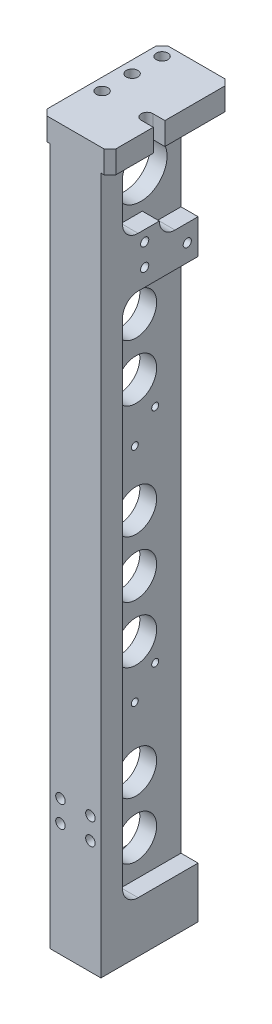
ISO-10303-21;
HEADER;
FILE_DESCRIPTION(('STEP AP214'),'2;1');
FILE_NAME('part.step','',(''),(''),'','','');
FILE_SCHEMA(('AUTOMOTIVE_DESIGN { 1 0 10303 214 1 1 1 1 }'));
ENDSEC;
DATA;
#1=APPLICATION_CONTEXT('core data for automotive mechanical design processes');
#2=APPLICATION_PROTOCOL_DEFINITION('international standard','automotive_design',2000,#1);
#3=PRODUCT_CONTEXT('',#1,'mechanical');
#4=PRODUCT('Part','Part','',(#3));
#5=PRODUCT_RELATED_PRODUCT_CATEGORY('part','',(#4));
#6=PRODUCT_DEFINITION_FORMATION('','',#4);
#7=PRODUCT_DEFINITION_CONTEXT('part definition',#1,'design');
#8=PRODUCT_DEFINITION('design','',#6,#7);
#9=PRODUCT_DEFINITION_SHAPE('','',#8);
#10=(LENGTH_UNIT() NAMED_UNIT(*) SI_UNIT(.MILLI.,.METRE.));
#11=(NAMED_UNIT(*) PLANE_ANGLE_UNIT() SI_UNIT($,.RADIAN.));
#12=(NAMED_UNIT(*) SI_UNIT($,.STERADIAN.) SOLID_ANGLE_UNIT());
#13=UNCERTAINTY_MEASURE_WITH_UNIT(LENGTH_MEASURE(1.E-05),#10,'distance_accuracy_value','');
#14=(GEOMETRIC_REPRESENTATION_CONTEXT(3) GLOBAL_UNCERTAINTY_ASSIGNED_CONTEXT((#13)) GLOBAL_UNIT_ASSIGNED_CONTEXT((#10,
#11,#12)) REPRESENTATION_CONTEXT('',''));
#15=CARTESIAN_POINT('',(0.,0.,0.));
#16=DIRECTION('',(0.,0.,1.));
#17=DIRECTION('',(1.,0.,0.));
#18=AXIS2_PLACEMENT_3D('',#15,#16,#17);
#19=CARTESIAN_POINT('',(-3.556,21.59,-41.148));
#20=DIRECTION('',(1.,0.,0.));
#21=DIRECTION('',(0.,0.,1.));
#22=AXIS2_PLACEMENT_3D('',#19,#20,#21);
#23=PLANE('',#22);
#24=CARTESIAN_POINT('',(-3.556,280.289,-24.13));
#25=DIRECTION('',(1.,0.,0.));
#26=DIRECTION('',(0.,0.,-1.));
#27=AXIS2_PLACEMENT_3D('',#24,#25,#26);
#28=CIRCLE('',#27,11.1125);
#29=CARTESIAN_POINT('',(-3.556,280.289,-35.2425));
#30=VERTEX_POINT('',#29);
#31=EDGE_CURVE('E572',#30,#30,#28,.T.);
#32=ORIENTED_EDGE('',*,*,#31,.T.);
#33=EDGE_LOOP('',(#32));
#34=FACE_BOUND('',#33,.T.);
#35=CARTESIAN_POINT('',(-3.556,204.851,-22.098));
#36=DIRECTION('',(-1.,0.,0.));
#37=DIRECTION('',(0.,0.,1.));
#38=AXIS2_PLACEMENT_3D('',#35,#36,#37);
#39=CIRCLE('',#38,8.73125);
#40=CARTESIAN_POINT('',(-3.556,204.851,-13.36675));
#41=VERTEX_POINT('',#40);
#42=EDGE_CURVE('E561',#41,#41,#39,.T.);
#43=ORIENTED_EDGE('',*,*,#42,.F.);
#44=EDGE_LOOP('',(#43));
#45=FACE_BOUND('',#44,.T.);
#46=CARTESIAN_POINT('',(-3.556,132.842,-22.098));
#47=DIRECTION('',(-1.,0.,0.));
#48=DIRECTION('',(0.,0.,1.));
#49=AXIS2_PLACEMENT_3D('',#46,#47,#48);
#50=CIRCLE('',#49,8.73125);
#51=CARTESIAN_POINT('',(-3.556,132.842,-13.36675));
#52=VERTEX_POINT('',#51);
#53=EDGE_CURVE('E553',#52,#52,#50,.T.);
#54=ORIENTED_EDGE('',*,*,#53,.F.);
#55=EDGE_LOOP('',(#54));
#56=FACE_BOUND('',#55,.T.);
#57=CARTESIAN_POINT('',(-3.556,108.839,-22.098));
#58=DIRECTION('',(-1.,0.,0.));
#59=DIRECTION('',(0.,0.,1.));
#60=AXIS2_PLACEMENT_3D('',#57,#58,#59);
#61=CIRCLE('',#60,8.73124999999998);
#62=CARTESIAN_POINT('',(-3.556,108.839,-13.36675));
#63=VERTEX_POINT('',#62);
#64=EDGE_CURVE('E549',#63,#63,#61,.T.);
#65=ORIENTED_EDGE('',*,*,#64,.F.);
#66=EDGE_LOOP('',(#65));
#67=FACE_BOUND('',#66,.T.);
#68=DIRECTION('',(0.,-1.,0.));
#69=VECTOR('',#68,1.);
#70=CARTESIAN_POINT('',(-3.556,295.275,-9.144));
#71=LINE('',#70,#69);
#72=CARTESIAN_POINT('',(-3.556,288.671,-9.144));
#73=VERTEX_POINT('',#72);
#74=CARTESIAN_POINT('',(-3.556,28.194,-9.14400000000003));
#75=VERTEX_POINT('',#74);
#76=EDGE_CURVE('E347',#73,#75,#71,.T.);
#77=ORIENTED_EDGE('',*,*,#76,.F.);
#78=CARTESIAN_POINT('',(-3.556,288.671,-15.748));
#79=DIRECTION('',(1.,0.,0.));
#80=DIRECTION('',(0.,0.,-1.));
#81=AXIS2_PLACEMENT_3D('',#78,#79,#80);
#82=CIRCLE('',#81,6.604);
#83=CARTESIAN_POINT('',(-3.556,295.275,-15.748));
#84=VERTEX_POINT('',#83);
#85=EDGE_CURVE('E466',#73,#84,#82,.F.);
#86=ORIENTED_EDGE('',*,*,#85,.T.);
#87=DIRECTION('',(0.,0.,1.));
#88=VECTOR('',#87,1.);
#89=CARTESIAN_POINT('',(-3.556,295.275,-41.148));
#90=LINE('',#89,#88);
#91=CARTESIAN_POINT('',(-3.556,295.275,-47.752));
#92=VERTEX_POINT('',#91);
#93=EDGE_CURVE('E350',#92,#84,#90,.T.);
#94=ORIENTED_EDGE('',*,*,#93,.F.);
#95=CARTESIAN_POINT('',(-3.556,288.671,-47.752));
#96=DIRECTION('',(1.,0.,0.));
#97=DIRECTION('',(0.,0.,-1.));
#98=AXIS2_PLACEMENT_3D('',#95,#96,#97);
#99=CIRCLE('',#98,6.604);
#100=CARTESIAN_POINT('',(-3.556,288.671,-41.148));
#101=VERTEX_POINT('',#100);
#102=EDGE_CURVE('E482',#92,#101,#99,.T.);
#103=ORIENTED_EDGE('',*,*,#102,.T.);
#104=DIRECTION('',(0.,1.,0.));
#105=VECTOR('',#104,1.);
#106=CARTESIAN_POINT('',(-3.556,295.275,-41.148));
#107=LINE('',#106,#105);
#108=CARTESIAN_POINT('',(-3.556,21.59,-41.148));
#109=VERTEX_POINT('',#108);
#110=EDGE_CURVE('E342',#109,#101,#107,.T.);
#111=ORIENTED_EDGE('',*,*,#110,.F.);
#112=DIRECTION('',(0.,0.,-1.));
#113=VECTOR('',#112,1.);
#114=CARTESIAN_POINT('',(-3.556,21.59,-41.148));
#115=LINE('',#114,#113);
#116=CARTESIAN_POINT('',(-3.556,21.59,-15.748));
#117=VERTEX_POINT('',#116);
#118=EDGE_CURVE('E345',#117,#109,#115,.T.);
#119=ORIENTED_EDGE('',*,*,#118,.F.);
#120=CARTESIAN_POINT('',(-3.556,28.194,-15.748));
#121=DIRECTION('',(1.,0.,0.));
#122=DIRECTION('',(0.,0.,-1.));
#123=AXIS2_PLACEMENT_3D('',#120,#121,#122);
#124=CIRCLE('',#123,6.604);
#125=EDGE_CURVE('E464',#117,#75,#124,.F.);
#126=ORIENTED_EDGE('',*,*,#125,.T.);
#127=EDGE_LOOP('',(#77,#86,#94,#103,#111,#119,#126));
#128=FACE_BOUND('',#127,.T.);
#129=CARTESIAN_POINT('',(-3.556,96.9010000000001,-30.2259999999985));
#130=DIRECTION('',(-1.,0.,0.));
#131=DIRECTION('',(0.,0.,1.));
#132=AXIS2_PLACEMENT_3D('',#129,#130,#131);
#133=CIRCLE('',#132,1.47319999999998);
#134=CARTESIAN_POINT('',(-3.556,96.9010000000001,-28.7527999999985));
#135=VERTEX_POINT('',#134);
#136=EDGE_CURVE('E625',#135,#135,#133,.T.);
#137=ORIENTED_EDGE('',*,*,#136,.F.);
#138=EDGE_LOOP('',(#137));
#139=FACE_BOUND('',#138,.T.);
#140=CARTESIAN_POINT('',(-3.556,86.741,-21.5899999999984));
#141=DIRECTION('',(-1.,0.,0.));
#142=DIRECTION('',(0.,0.,1.));
#143=AXIS2_PLACEMENT_3D('',#140,#141,#142);
#144=CIRCLE('',#143,1.47319999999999);
#145=CARTESIAN_POINT('',(-3.556,86.741,-20.1167999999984));
#146=VERTEX_POINT('',#145);
#147=EDGE_CURVE('E619',#146,#146,#144,.T.);
#148=ORIENTED_EDGE('',*,*,#147,.F.);
#149=EDGE_LOOP('',(#148));
#150=FACE_BOUND('',#149,.T.);
#151=CARTESIAN_POINT('',(-3.556,180.721,-21.5900000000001));
#152=DIRECTION('',(-1.,0.,0.));
#153=DIRECTION('',(0.,0.,1.));
#154=AXIS2_PLACEMENT_3D('',#151,#152,#153);
#155=CIRCLE('',#154,1.47319999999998);
#156=CARTESIAN_POINT('',(-3.556,180.721,-20.1168000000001));
#157=VERTEX_POINT('',#156);
#158=EDGE_CURVE('E613',#157,#157,#155,.T.);
#159=ORIENTED_EDGE('',*,*,#158,.F.);
#160=EDGE_LOOP('',(#159));
#161=FACE_BOUND('',#160,.T.);
#162=CARTESIAN_POINT('',(-3.556,190.881,-30.226));
#163=DIRECTION('',(-1.,0.,0.));
#164=DIRECTION('',(0.,0.,1.));
#165=AXIS2_PLACEMENT_3D('',#162,#163,#164);
#166=CIRCLE('',#165,1.47319999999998);
#167=CARTESIAN_POINT('',(-3.556,190.881,-28.7528));
#168=VERTEX_POINT('',#167);
#169=EDGE_CURVE('E607',#168,#168,#166,.T.);
#170=ORIENTED_EDGE('',*,*,#169,.F.);
#171=EDGE_LOOP('',(#170));
#172=FACE_BOUND('',#171,.T.);
#173=CARTESIAN_POINT('',(-3.556,36.83,-22.098));
#174=DIRECTION('',(-1.,0.,0.));
#175=DIRECTION('',(0.,0.,1.));
#176=AXIS2_PLACEMENT_3D('',#173,#174,#175);
#177=CIRCLE('',#176,8.73124999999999);
#178=CARTESIAN_POINT('',(-3.556,36.83,-13.36675));
#179=VERTEX_POINT('',#178);
#180=EDGE_CURVE('E601',#179,#179,#177,.T.);
#181=ORIENTED_EDGE('',*,*,#180,.F.);
#182=EDGE_LOOP('',(#181));
#183=FACE_BOUND('',#182,.T.);
#184=CARTESIAN_POINT('',(-3.556,60.833,-22.098));
#185=DIRECTION('',(-1.,0.,0.));
#186=DIRECTION('',(0.,0.,1.));
#187=AXIS2_PLACEMENT_3D('',#184,#185,#186);
#188=CIRCLE('',#187,8.73124999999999);
#189=CARTESIAN_POINT('',(-3.556,60.833,-13.36675));
#190=VERTEX_POINT('',#189);
#191=EDGE_CURVE('E548',#190,#190,#188,.T.);
#192=ORIENTED_EDGE('',*,*,#191,.F.);
#193=EDGE_LOOP('',(#192));
#194=FACE_BOUND('',#193,.T.);
#195=CARTESIAN_POINT('',(-3.556,156.845,-22.098));
#196=DIRECTION('',(-1.,0.,0.));
#197=DIRECTION('',(0.,0.,1.));
#198=AXIS2_PLACEMENT_3D('',#195,#196,#197);
#199=CIRCLE('',#198,8.73125);
#200=CARTESIAN_POINT('',(-3.556,156.845,-13.36675));
#201=VERTEX_POINT('',#200);
#202=EDGE_CURVE('E557',#201,#201,#199,.T.);
#203=ORIENTED_EDGE('',*,*,#202,.F.);
#204=EDGE_LOOP('',(#203));
#205=FACE_BOUND('',#204,.T.);
#206=CARTESIAN_POINT('',(-3.556,228.854,-22.098));
#207=DIRECTION('',(-1.,0.,0.));
#208=DIRECTION('',(0.,0.,1.));
#209=AXIS2_PLACEMENT_3D('',#206,#207,#208);
#210=CIRCLE('',#209,8.73125);
#211=CARTESIAN_POINT('',(-3.556,228.854,-13.36675));
#212=VERTEX_POINT('',#211);
#213=EDGE_CURVE('E564',#212,#212,#210,.T.);
#214=ORIENTED_EDGE('',*,*,#213,.F.);
#215=EDGE_LOOP('',(#214));
#216=FACE_BOUND('',#215,.T.);
#217=ADVANCED_FACE('F44',(#34,#45,#56,#67,#128,#139,#150,#161,#172,#183,#194,#205,#216),#23,.F.);
#218=CARTESIAN_POINT('',(14.605,236.234886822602,0.));
#219=DIRECTION('',(1.,0.,0.));
#220=DIRECTION('',(0.,0.,-1.));
#221=AXIS2_PLACEMENT_3D('',#218,#219,#220);
#222=PLANE('',#221);
#223=DIRECTION('',(0.,1.,0.));
#224=VECTOR('',#223,1.);
#225=CARTESIAN_POINT('',(14.605,288.206574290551,-18.3705499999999));
#226=LINE('',#225,#224);
#227=CARTESIAN_POINT('',(14.605,295.275,-18.3705499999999));
#228=VERTEX_POINT('',#227);
#229=CARTESIAN_POINT('',(14.605,304.8,-18.3705499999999));
#230=VERTEX_POINT('',#229);
#231=EDGE_CURVE('E630',#228,#230,#226,.T.);
#232=ORIENTED_EDGE('',*,*,#231,.T.);
#233=DIRECTION('',(0.,0.,-1.));
#234=VECTOR('',#233,1.);
#235=CARTESIAN_POINT('',(14.605,304.8,0.));
#236=LINE('',#235,#234);
#237=CARTESIAN_POINT('',(14.605,304.8,-2.54000000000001));
#238=VERTEX_POINT('',#237);
#239=EDGE_CURVE('E304',#238,#230,#236,.T.);
#240=ORIENTED_EDGE('',*,*,#239,.F.);
#241=DIRECTION('',(0.,-1.,0.));
#242=VECTOR('',#241,1.);
#243=CARTESIAN_POINT('',(14.605,295.275,-2.54000000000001));
#244=LINE('',#243,#242);
#245=CARTESIAN_POINT('',(14.605,295.275,-2.54000000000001));
#246=VERTEX_POINT('',#245);
#247=EDGE_CURVE('E53',#238,#246,#244,.T.);
#248=ORIENTED_EDGE('',*,*,#247,.T.);
#249=DIRECTION('',(0.,0.,1.));
#250=VECTOR('',#249,1.);
#251=CARTESIAN_POINT('',(14.605,295.275,0.));
#252=LINE('',#251,#250);
#253=EDGE_CURVE('E316',#228,#246,#252,.T.);
#254=ORIENTED_EDGE('',*,*,#253,.F.);
#255=EDGE_LOOP('',(#232,#240,#248,#254));
#256=FACE_BOUND('',#255,.T.);
#257=ADVANCED_FACE('F734',(#256),#222,.T.);
#258=CARTESIAN_POINT('',(3.556,21.59,-41.148));
#259=DIRECTION('',(-1.,0.,0.));
#260=DIRECTION('',(0.,0.,1.));
#261=AXIS2_PLACEMENT_3D('',#258,#259,#260);
#262=PLANE('',#261);
#263=CARTESIAN_POINT('',(3.556,228.854,-22.098));
#264=DIRECTION('',(-1.,0.,0.));
#265=DIRECTION('',(0.,0.,1.));
#266=AXIS2_PLACEMENT_3D('',#263,#264,#265);
#267=CIRCLE('',#266,8.73125);
#268=CARTESIAN_POINT('',(3.556,228.854,-13.36675));
#269=VERTEX_POINT('',#268);
#270=EDGE_CURVE('E562',#269,#269,#267,.T.);
#271=ORIENTED_EDGE('',*,*,#270,.T.);
#272=EDGE_LOOP('',(#271));
#273=FACE_BOUND('',#272,.T.);
#274=CARTESIAN_POINT('',(3.556,204.851,-22.098));
#275=DIRECTION('',(-1.,0.,0.));
#276=DIRECTION('',(0.,0.,1.));
#277=AXIS2_PLACEMENT_3D('',#274,#275,#276);
#278=CIRCLE('',#277,8.73125);
#279=CARTESIAN_POINT('',(3.556,204.851,-13.36675));
#280=VERTEX_POINT('',#279);
#281=EDGE_CURVE('E558',#280,#280,#278,.T.);
#282=ORIENTED_EDGE('',*,*,#281,.T.);
#283=EDGE_LOOP('',(#282));
#284=FACE_BOUND('',#283,.T.);
#285=CARTESIAN_POINT('',(3.556,156.845,-22.098));
#286=DIRECTION('',(-1.,0.,0.));
#287=DIRECTION('',(0.,0.,1.));
#288=AXIS2_PLACEMENT_3D('',#285,#286,#287);
#289=CIRCLE('',#288,8.73125);
#290=CARTESIAN_POINT('',(3.556,156.845,-13.36675));
#291=VERTEX_POINT('',#290);
#292=EDGE_CURVE('E554',#291,#291,#289,.T.);
#293=ORIENTED_EDGE('',*,*,#292,.T.);
#294=EDGE_LOOP('',(#293));
#295=FACE_BOUND('',#294,.T.);
#296=CARTESIAN_POINT('',(3.556,132.842,-22.098));
#297=DIRECTION('',(-1.,0.,0.));
#298=DIRECTION('',(0.,0.,1.));
#299=AXIS2_PLACEMENT_3D('',#296,#297,#298);
#300=CIRCLE('',#299,8.73125);
#301=CARTESIAN_POINT('',(3.556,132.842,-13.36675));
#302=VERTEX_POINT('',#301);
#303=EDGE_CURVE('E550',#302,#302,#300,.T.);
#304=ORIENTED_EDGE('',*,*,#303,.T.);
#305=EDGE_LOOP('',(#304));
#306=FACE_BOUND('',#305,.T.);
#307=CARTESIAN_POINT('',(3.556,108.839,-22.098));
#308=DIRECTION('',(-1.,0.,0.));
#309=DIRECTION('',(0.,0.,1.));
#310=AXIS2_PLACEMENT_3D('',#307,#308,#309);
#311=CIRCLE('',#310,8.73124999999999);
#312=CARTESIAN_POINT('',(3.556,108.839,-13.36675));
#313=VERTEX_POINT('',#312);
#314=EDGE_CURVE('E545',#313,#313,#311,.T.);
#315=ORIENTED_EDGE('',*,*,#314,.T.);
#316=EDGE_LOOP('',(#315));
#317=FACE_BOUND('',#316,.T.);
#318=CARTESIAN_POINT('',(3.556,60.833,-22.098));
#319=DIRECTION('',(-1.,0.,0.));
#320=DIRECTION('',(0.,0.,1.));
#321=AXIS2_PLACEMENT_3D('',#318,#319,#320);
#322=CIRCLE('',#321,8.73125);
#323=CARTESIAN_POINT('',(3.556,60.833,-13.36675));
#324=VERTEX_POINT('',#323);
#325=EDGE_CURVE('E598',#324,#324,#322,.T.);
#326=ORIENTED_EDGE('',*,*,#325,.T.);
#327=EDGE_LOOP('',(#326));
#328=FACE_BOUND('',#327,.T.);
#329=CARTESIAN_POINT('',(3.556,36.83,-22.098));
#330=DIRECTION('',(-1.,0.,0.));
#331=DIRECTION('',(0.,0.,1.));
#332=AXIS2_PLACEMENT_3D('',#329,#330,#331);
#333=CIRCLE('',#332,8.73124999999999);
#334=CARTESIAN_POINT('',(3.556,36.83,-13.36675));
#335=VERTEX_POINT('',#334);
#336=EDGE_CURVE('E604',#335,#335,#333,.T.);
#337=ORIENTED_EDGE('',*,*,#336,.T.);
#338=EDGE_LOOP('',(#337));
#339=FACE_BOUND('',#338,.T.);
#340=CARTESIAN_POINT('',(3.556,190.881,-30.226));
#341=DIRECTION('',(-1.,0.,0.));
#342=DIRECTION('',(0.,0.,1.));
#343=AXIS2_PLACEMENT_3D('',#340,#341,#342);
#344=CIRCLE('',#343,1.47319999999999);
#345=CARTESIAN_POINT('',(3.556,190.881,-28.7528));
#346=VERTEX_POINT('',#345);
#347=EDGE_CURVE('E610',#346,#346,#344,.T.);
#348=ORIENTED_EDGE('',*,*,#347,.T.);
#349=EDGE_LOOP('',(#348));
#350=FACE_BOUND('',#349,.T.);
#351=CARTESIAN_POINT('',(3.556,180.721,-21.5900000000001));
#352=DIRECTION('',(-1.,0.,0.));
#353=DIRECTION('',(0.,0.,1.));
#354=AXIS2_PLACEMENT_3D('',#351,#352,#353);
#355=CIRCLE('',#354,1.47319999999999);
#356=CARTESIAN_POINT('',(3.556,180.721,-20.1168000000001));
#357=VERTEX_POINT('',#356);
#358=EDGE_CURVE('E616',#357,#357,#355,.T.);
#359=ORIENTED_EDGE('',*,*,#358,.T.);
#360=EDGE_LOOP('',(#359));
#361=FACE_BOUND('',#360,.T.);
#362=CARTESIAN_POINT('',(3.556,86.741,-21.5899999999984));
#363=DIRECTION('',(-1.,0.,0.));
#364=DIRECTION('',(0.,0.,1.));
#365=AXIS2_PLACEMENT_3D('',#362,#363,#364);
#366=CIRCLE('',#365,1.47319999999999);
#367=CARTESIAN_POINT('',(3.556,86.741,-20.1167999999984));
#368=VERTEX_POINT('',#367);
#369=EDGE_CURVE('E622',#368,#368,#366,.T.);
#370=ORIENTED_EDGE('',*,*,#369,.T.);
#371=EDGE_LOOP('',(#370));
#372=FACE_BOUND('',#371,.T.);
#373=CARTESIAN_POINT('',(3.556,96.9010000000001,-30.2259999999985));
#374=DIRECTION('',(-1.,0.,0.));
#375=DIRECTION('',(0.,0.,1.));
#376=AXIS2_PLACEMENT_3D('',#373,#374,#375);
#377=CIRCLE('',#376,1.47319999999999);
#378=CARTESIAN_POINT('',(3.556,96.9010000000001,-28.7527999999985));
#379=VERTEX_POINT('',#378);
#380=EDGE_CURVE('E300',#379,#379,#377,.T.);
#381=ORIENTED_EDGE('',*,*,#380,.T.);
#382=EDGE_LOOP('',(#381));
#383=FACE_BOUND('',#382,.T.);
#384=DIRECTION('',(0.,-1.,0.));
#385=VECTOR('',#384,1.);
#386=CARTESIAN_POINT('',(3.556,295.275,-9.144));
#387=LINE('',#386,#385);
#388=CARTESIAN_POINT('',(3.556,237.49,-9.144));
#389=VERTEX_POINT('',#388);
#390=CARTESIAN_POINT('',(3.556,28.194,-9.14400000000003));
#391=VERTEX_POINT('',#390);
#392=EDGE_CURVE('E368',#389,#391,#387,.T.);
#393=ORIENTED_EDGE('',*,*,#392,.T.);
#394=CARTESIAN_POINT('',(3.556,28.194,-15.748));
#395=DIRECTION('',(-1.,0.,0.));
#396=DIRECTION('',(0.,0.,1.));
#397=AXIS2_PLACEMENT_3D('',#394,#395,#396);
#398=CIRCLE('',#397,6.604);
#399=CARTESIAN_POINT('',(3.556,21.59,-15.748));
#400=VERTEX_POINT('',#399);
#401=EDGE_CURVE('E475',#391,#400,#398,.F.);
#402=ORIENTED_EDGE('',*,*,#401,.T.);
#403=DIRECTION('',(0.,0.,-1.));
#404=VECTOR('',#403,1.);
#405=CARTESIAN_POINT('',(3.556,21.59,-41.148));
#406=LINE('',#405,#404);
#407=CARTESIAN_POINT('',(3.556,21.59,-41.148));
#408=VERTEX_POINT('',#407);
#409=EDGE_CURVE('E371',#400,#408,#406,.T.);
#410=ORIENTED_EDGE('',*,*,#409,.T.);
#411=DIRECTION('',(0.,1.,0.));
#412=VECTOR('',#411,1.);
#413=CARTESIAN_POINT('',(3.556,295.275,-41.148));
#414=LINE('',#413,#412);
#415=CARTESIAN_POINT('',(3.556,244.094,-41.148));
#416=VERTEX_POINT('',#415);
#417=EDGE_CURVE('E362',#408,#416,#414,.T.);
#418=ORIENTED_EDGE('',*,*,#417,.T.);
#419=DIRECTION('',(0.,0.,-1.));
#420=VECTOR('',#419,1.);
#421=CARTESIAN_POINT('',(3.556,244.094,-9.144));
#422=LINE('',#421,#420);
#423=CARTESIAN_POINT('',(3.556,244.094,-15.748));
#424=VERTEX_POINT('',#423);
#425=EDGE_CURVE('E328',#424,#416,#422,.T.);
#426=ORIENTED_EDGE('',*,*,#425,.F.);
#427=CARTESIAN_POINT('',(3.556,237.49,-15.748));
#428=DIRECTION('',(-1.,0.,0.));
#429=DIRECTION('',(0.,0.,1.));
#430=AXIS2_PLACEMENT_3D('',#427,#428,#429);
#431=CIRCLE('',#430,6.604);
#432=EDGE_CURVE('E416',#424,#389,#431,.F.);
#433=ORIENTED_EDGE('',*,*,#432,.T.);
#434=EDGE_LOOP('',(#393,#402,#410,#418,#426,#433));
#435=FACE_BOUND('',#434,.T.);
#436=ADVANCED_FACE('F740',(#273,#284,#295,#306,#317,#328,#339,#350,#361,#372,#383,#435),#262,.F.);
#437=CARTESIAN_POINT('',(3.556,280.289,-24.13));
#438=DIRECTION('',(1.,0.,0.));
#439=DIRECTION('',(0.,0.,-1.));
#440=AXIS2_PLACEMENT_3D('',#437,#438,#439);
#441=CIRCLE('',#440,11.1125);
#442=CARTESIAN_POINT('',(3.556,280.289,-35.2425));
#443=VERTEX_POINT('',#442);
#444=EDGE_CURVE('E567',#443,#443,#441,.T.);
#445=ORIENTED_EDGE('',*,*,#444,.F.);
#446=EDGE_LOOP('',(#445));
#447=FACE_BOUND('',#446,.T.);
#448=DIRECTION('',(0.,0.,1.));
#449=VECTOR('',#448,1.);
#450=CARTESIAN_POINT('',(3.556,295.275,-41.148));
#451=LINE('',#450,#449);
#452=CARTESIAN_POINT('',(3.556,295.275,-47.752));
#453=VERTEX_POINT('',#452);
#454=CARTESIAN_POINT('',(3.556,295.275,-15.748));
#455=VERTEX_POINT('',#454);
#456=EDGE_CURVE('E365',#453,#455,#451,.T.);
#457=ORIENTED_EDGE('',*,*,#456,.T.);
#458=CARTESIAN_POINT('',(3.556,288.671,-15.748));
#459=DIRECTION('',(-1.,0.,0.));
#460=DIRECTION('',(0.,0.,1.));
#461=AXIS2_PLACEMENT_3D('',#458,#459,#460);
#462=CIRCLE('',#461,6.604);
#463=CARTESIAN_POINT('',(3.556,288.671,-9.144));
#464=VERTEX_POINT('',#463);
#465=EDGE_CURVE('E480',#455,#464,#462,.F.);
#466=ORIENTED_EDGE('',*,*,#465,.T.);
#467=CARTESIAN_POINT('',(3.556,271.907,-9.144));
#468=VERTEX_POINT('',#467);
#469=EDGE_CURVE('E369',#464,#468,#387,.T.);
#470=ORIENTED_EDGE('',*,*,#469,.T.);
#471=CARTESIAN_POINT('',(3.556,271.907,-15.748));
#472=DIRECTION('',(-1.,0.,0.));
#473=DIRECTION('',(0.,0.,1.));
#474=AXIS2_PLACEMENT_3D('',#471,#472,#473);
#475=CIRCLE('',#474,6.604);
#476=CARTESIAN_POINT('',(3.556,265.303,-15.7480000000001));
#477=VERTEX_POINT('',#476);
#478=EDGE_CURVE('E399',#468,#477,#475,.F.);
#479=ORIENTED_EDGE('',*,*,#478,.T.);
#480=DIRECTION('',(0.,0.,1.));
#481=VECTOR('',#480,1.);
#482=CARTESIAN_POINT('',(3.556,265.303,-9.144));
#483=LINE('',#482,#481);
#484=CARTESIAN_POINT('',(3.556,265.303,-24.764371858));
#485=VERTEX_POINT('',#484);
#486=EDGE_CURVE('E332',#485,#477,#483,.T.);
#487=ORIENTED_EDGE('',*,*,#486,.F.);
#488=CARTESIAN_POINT('',(3.556,265.303,-31.368371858));
#489=DIRECTION('',(-1.,0.,0.));
#490=DIRECTION('',(0.,0.,1.));
#491=AXIS2_PLACEMENT_3D('',#488,#489,#490);
#492=CIRCLE('',#491,6.604);
#493=CARTESIAN_POINT('',(3.556,258.699,-31.368371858));
#494=VERTEX_POINT('',#493);
#495=EDGE_CURVE('E401',#485,#494,#492,.F.);
#496=ORIENTED_EDGE('',*,*,#495,.T.);
#497=DIRECTION('',(0.,0.,1.));
#498=VECTOR('',#497,1.);
#499=CARTESIAN_POINT('',(3.556,258.699,-24.764371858));
#500=LINE('',#499,#498);
#501=CARTESIAN_POINT('',(3.556,258.699,-41.148));
#502=VERTEX_POINT('',#501);
#503=EDGE_CURVE('E675',#502,#494,#500,.T.);
#504=ORIENTED_EDGE('',*,*,#503,.F.);
#505=CARTESIAN_POINT('',(3.556,288.671,-41.148));
#506=VERTEX_POINT('',#505);
#507=EDGE_CURVE('E361',#502,#506,#414,.T.);
#508=ORIENTED_EDGE('',*,*,#507,.T.);
#509=CARTESIAN_POINT('',(3.556,288.671,-47.752));
#510=DIRECTION('',(-1.,0.,0.));
#511=DIRECTION('',(0.,0.,1.));
#512=AXIS2_PLACEMENT_3D('',#509,#510,#511);
#513=CIRCLE('',#512,6.604);
#514=EDGE_CURVE('E484',#506,#453,#513,.T.);
#515=ORIENTED_EDGE('',*,*,#514,.T.);
#516=EDGE_LOOP('',(#457,#466,#470,#479,#487,#496,#504,#508,#515));
#517=FACE_BOUND('',#516,.T.);
#518=ADVANCED_FACE('F758',(#447,#517),#262,.F.);
#519=CARTESIAN_POINT('',(-10.795,304.8,-41.148));
#520=DIRECTION('',(1.,0.,0.));
#521=DIRECTION('',(0.,0.,-1.));
#522=AXIS2_PLACEMENT_3D('',#519,#520,#521);
#523=PLANE('',#522);
#524=DIRECTION('',(0.,0.,1.));
#525=VECTOR('',#524,1.);
#526=CARTESIAN_POINT('',(-10.795,295.275,-41.148));
#527=LINE('',#526,#525);
#528=CARTESIAN_POINT('',(-10.795,295.275,-15.748));
#529=VERTEX_POINT('',#528);
#530=CARTESIAN_POINT('',(-10.795,295.275,0.));
#531=VERTEX_POINT('',#530);
#532=EDGE_CURVE('E319',#529,#531,#527,.T.);
#533=ORIENTED_EDGE('',*,*,#532,.F.);
#534=CARTESIAN_POINT('',(-10.795,288.671,-15.748));
#535=DIRECTION('',(1.,0.,0.));
#536=DIRECTION('',(0.,0.,-1.));
#537=AXIS2_PLACEMENT_3D('',#534,#535,#536);
#538=CIRCLE('',#537,6.604);
#539=CARTESIAN_POINT('',(-10.795,288.671,-9.144));
#540=VERTEX_POINT('',#539);
#541=EDGE_CURVE('E487',#529,#540,#538,.T.);
#542=ORIENTED_EDGE('',*,*,#541,.T.);
#543=DIRECTION('',(0.,-1.,0.));
#544=VECTOR('',#543,1.);
#545=CARTESIAN_POINT('',(-10.795,295.275,-9.144));
#546=LINE('',#545,#544);
#547=CARTESIAN_POINT('',(-10.795,28.194,-9.14400000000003));
#548=VERTEX_POINT('',#547);
#549=EDGE_CURVE('E339',#540,#548,#546,.T.);
#550=ORIENTED_EDGE('',*,*,#549,.T.);
#551=CARTESIAN_POINT('',(-10.795,28.194,-15.748));
#552=DIRECTION('',(1.,0.,0.));
#553=DIRECTION('',(0.,0.,-1.));
#554=AXIS2_PLACEMENT_3D('',#551,#552,#553);
#555=CIRCLE('',#554,6.604);
#556=CARTESIAN_POINT('',(-10.795,21.59,-15.748));
#557=VERTEX_POINT('',#556);
#558=EDGE_CURVE('E489',#548,#557,#555,.T.);
#559=ORIENTED_EDGE('',*,*,#558,.T.);
#560=DIRECTION('',(0.,0.,-1.));
#561=VECTOR('',#560,1.);
#562=CARTESIAN_POINT('',(-10.795,21.59,-41.148));
#563=LINE('',#562,#561);
#564=CARTESIAN_POINT('',(-10.795,21.59,-41.148));
#565=VERTEX_POINT('',#564);
#566=EDGE_CURVE('E335',#557,#565,#563,.T.);
#567=ORIENTED_EDGE('',*,*,#566,.T.);
#568=DIRECTION('',(0.,-1.,0.));
#569=VECTOR('',#568,1.);
#570=CARTESIAN_POINT('',(-10.795,304.8,-41.148));
#571=LINE('',#570,#569);
#572=CARTESIAN_POINT('',(-10.795,0.,-41.148));
#573=VERTEX_POINT('',#572);
#574=EDGE_CURVE('E391',#565,#573,#571,.T.);
#575=ORIENTED_EDGE('',*,*,#574,.T.);
#576=DIRECTION('',(0.,0.,1.));
#577=VECTOR('',#576,1.);
#578=CARTESIAN_POINT('',(-10.795,0.,-41.148));
#579=LINE('',#578,#577);
#580=CARTESIAN_POINT('',(-10.795,0.,0.));
#581=VERTEX_POINT('',#580);
#582=EDGE_CURVE('E376',#573,#581,#579,.T.);
#583=ORIENTED_EDGE('',*,*,#582,.T.);
#584=DIRECTION('',(0.,-1.,0.));
#585=VECTOR('',#584,1.);
#586=CARTESIAN_POINT('',(-10.795,304.8,0.));
#587=LINE('',#586,#585);
#588=EDGE_CURVE('E397',#531,#581,#587,.T.);
#589=ORIENTED_EDGE('',*,*,#588,.F.);
#590=EDGE_LOOP('',(#533,#542,#550,#559,#567,#575,#583,#589));
#591=FACE_BOUND('',#590,.T.);
#592=ADVANCED_FACE('F783',(#591),#523,.F.);
#593=CARTESIAN_POINT('',(-10.795,304.8,-41.148));
#594=DIRECTION('',(0.,0.,1.));
#595=DIRECTION('',(1.,0.,0.));
#596=AXIS2_PLACEMENT_3D('',#593,#594,#595);
#597=PLANE('',#596);
#598=ORIENTED_EDGE('',*,*,#110,.T.);
#599=DIRECTION('',(-1.,0.,0.));
#600=VECTOR('',#599,1.);
#601=CARTESIAN_POINT('',(3.556,288.671,-41.148));
#602=LINE('',#601,#600);
#603=EDGE_CURVE('E457',#101,#506,#602,.F.);
#604=ORIENTED_EDGE('',*,*,#603,.T.);
#605=ORIENTED_EDGE('',*,*,#507,.F.);
#606=DIRECTION('',(-1.,0.,0.));
#607=VECTOR('',#606,1.);
#608=CARTESIAN_POINT('',(10.795,258.699,-41.148));
#609=LINE('',#608,#607);
#610=CARTESIAN_POINT('',(10.795,258.699,-41.148));
#611=VERTEX_POINT('',#610);
#612=EDGE_CURVE('E683',#611,#502,#609,.T.);
#613=ORIENTED_EDGE('',*,*,#612,.F.);
#614=DIRECTION('',(0.,1.,0.));
#615=VECTOR('',#614,1.);
#616=CARTESIAN_POINT('',(10.795,244.094,-41.148));
#617=LINE('',#616,#615);
#618=CARTESIAN_POINT('',(10.795,244.094,-41.148));
#619=VERTEX_POINT('',#618);
#620=EDGE_CURVE('E678',#619,#611,#617,.T.);
#621=ORIENTED_EDGE('',*,*,#620,.F.);
#622=DIRECTION('',(-1.,0.,0.));
#623=VECTOR('',#622,1.);
#624=CARTESIAN_POINT('',(10.795,244.094,-41.148));
#625=LINE('',#624,#623);
#626=EDGE_CURVE('E310',#619,#416,#625,.T.);
#627=ORIENTED_EDGE('',*,*,#626,.T.);
#628=ORIENTED_EDGE('',*,*,#417,.F.);
#629=DIRECTION('',(1.,0.,0.));
#630=VECTOR('',#629,1.);
#631=CARTESIAN_POINT('',(3.556,21.59,-41.148));
#632=LINE('',#631,#630);
#633=CARTESIAN_POINT('',(10.795,21.59,-41.148));
#634=VERTEX_POINT('',#633);
#635=EDGE_CURVE('E373',#408,#634,#632,.T.);
#636=ORIENTED_EDGE('',*,*,#635,.T.);
#637=DIRECTION('',(0.,-1.,0.));
#638=VECTOR('',#637,1.);
#639=CARTESIAN_POINT('',(10.795,304.8,-41.148));
#640=LINE('',#639,#638);
#641=CARTESIAN_POINT('',(10.795,0.,-41.148));
#642=VERTEX_POINT('',#641);
#643=EDGE_CURVE('E393',#634,#642,#640,.T.);
#644=ORIENTED_EDGE('',*,*,#643,.T.);
#645=DIRECTION('',(-1.,0.,0.));
#646=VECTOR('',#645,1.);
#647=CARTESIAN_POINT('',(-10.795,0.,-41.148));
#648=LINE('',#647,#646);
#649=EDGE_CURVE('E385',#642,#573,#648,.T.);
#650=ORIENTED_EDGE('',*,*,#649,.T.);
#651=ORIENTED_EDGE('',*,*,#574,.F.);
#652=DIRECTION('',(-1.,0.,0.));
#653=VECTOR('',#652,1.);
#654=CARTESIAN_POINT('',(-3.556,21.59,-41.148));
#655=LINE('',#654,#653);
#656=EDGE_CURVE('E353',#109,#565,#655,.T.);
#657=ORIENTED_EDGE('',*,*,#656,.F.);
#658=EDGE_LOOP('',(#598,#604,#605,#613,#621,#627,#628,#636,#644,#650,#651,#657));
#659=FACE_BOUND('',#658,.T.);
#660=ADVANCED_FACE('F779',(#659),#597,.F.);
#661=CARTESIAN_POINT('',(10.795,304.8,-41.148));
#662=DIRECTION('',(-1.,0.,0.));
#663=DIRECTION('',(0.,0.,1.));
#664=AXIS2_PLACEMENT_3D('',#661,#662,#663);
#665=PLANE('',#664);
#666=CARTESIAN_POINT('',(10.795,251.3965,-36.576));
#667=DIRECTION('',(1.,0.,0.));
#668=DIRECTION('',(0.,0.,-1.));
#669=AXIS2_PLACEMENT_3D('',#666,#667,#668);
#670=CIRCLE('',#669,1.72719999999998);
#671=CARTESIAN_POINT('',(10.795,251.3965,-38.3032));
#672=VERTEX_POINT('',#671);
#673=EDGE_CURVE('E648',#672,#672,#670,.T.);
#674=ORIENTED_EDGE('',*,*,#673,.F.);
#675=EDGE_LOOP('',(#674));
#676=FACE_BOUND('',#675,.T.);
#677=CARTESIAN_POINT('',(10.795,260.731,-18.542));
#678=DIRECTION('',(1.,0.,0.));
#679=DIRECTION('',(0.,0.,-1.));
#680=AXIS2_PLACEMENT_3D('',#677,#678,#679);
#681=CIRCLE('',#680,1.72719999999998);
#682=CARTESIAN_POINT('',(10.795,260.731,-20.2692));
#683=VERTEX_POINT('',#682);
#684=EDGE_CURVE('E654',#683,#683,#681,.T.);
#685=ORIENTED_EDGE('',*,*,#684,.F.);
#686=EDGE_LOOP('',(#685));
#687=FACE_BOUND('',#686,.T.);
#688=CARTESIAN_POINT('',(10.795,251.3965,-18.542));
#689=DIRECTION('',(1.,0.,0.));
#690=DIRECTION('',(0.,0.,-1.));
#691=AXIS2_PLACEMENT_3D('',#688,#689,#690);
#692=CIRCLE('',#691,1.72719999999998);
#693=CARTESIAN_POINT('',(10.795,251.3965,-20.2692));
#694=VERTEX_POINT('',#693);
#695=EDGE_CURVE('E660',#694,#694,#692,.T.);
#696=ORIENTED_EDGE('',*,*,#695,.F.);
#697=EDGE_LOOP('',(#696));
#698=FACE_BOUND('',#697,.T.);
#699=DIRECTION('',(0.,0.,-1.));
#700=VECTOR('',#699,1.);
#701=CARTESIAN_POINT('',(10.795,295.275,-41.148));
#702=LINE('',#701,#700);
#703=CARTESIAN_POINT('',(10.795,295.275,0.));
#704=VERTEX_POINT('',#703);
#705=CARTESIAN_POINT('',(10.795,295.275,-15.748));
#706=VERTEX_POINT('',#705);
#707=EDGE_CURVE('E322',#704,#706,#702,.T.);
#708=ORIENTED_EDGE('',*,*,#707,.F.);
#709=DIRECTION('',(0.,-1.,0.));
#710=VECTOR('',#709,1.);
#711=CARTESIAN_POINT('',(10.795,304.8,0.));
#712=LINE('',#711,#710);
#713=CARTESIAN_POINT('',(10.795,0.,0.));
#714=VERTEX_POINT('',#713);
#715=EDGE_CURVE('E395',#704,#714,#712,.T.);
#716=ORIENTED_EDGE('',*,*,#715,.T.);
#717=DIRECTION('',(0.,0.,-1.));
#718=VECTOR('',#717,1.);
#719=CARTESIAN_POINT('',(10.795,0.,-41.148));
#720=LINE('',#719,#718);
#721=EDGE_CURVE('E382',#714,#642,#720,.T.);
#722=ORIENTED_EDGE('',*,*,#721,.T.);
#723=ORIENTED_EDGE('',*,*,#643,.F.);
#724=DIRECTION('',(0.,0.,-1.));
#725=VECTOR('',#724,1.);
#726=CARTESIAN_POINT('',(10.795,21.59,-41.148));
#727=LINE('',#726,#725);
#728=CARTESIAN_POINT('',(10.795,21.59,-15.748));
#729=VERTEX_POINT('',#728);
#730=EDGE_CURVE('E359',#729,#634,#727,.T.);
#731=ORIENTED_EDGE('',*,*,#730,.F.);
#732=CARTESIAN_POINT('',(10.795,28.194,-15.748));
#733=DIRECTION('',(-1.,0.,0.));
#734=DIRECTION('',(0.,0.,1.));
#735=AXIS2_PLACEMENT_3D('',#732,#733,#734);
#736=CIRCLE('',#735,6.604);
#737=CARTESIAN_POINT('',(10.795,28.194,-9.14400000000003));
#738=VERTEX_POINT('',#737);
#739=EDGE_CURVE('E491',#729,#738,#736,.T.);
#740=ORIENTED_EDGE('',*,*,#739,.T.);
#741=DIRECTION('',(0.,-1.,0.));
#742=VECTOR('',#741,1.);
#743=CARTESIAN_POINT('',(10.795,295.275,-9.144));
#744=LINE('',#743,#742);
#745=CARTESIAN_POINT('',(10.795,237.49,-9.144));
#746=VERTEX_POINT('',#745);
#747=EDGE_CURVE('E356',#746,#738,#744,.T.);
#748=ORIENTED_EDGE('',*,*,#747,.F.);
#749=CARTESIAN_POINT('',(10.795,237.49,-15.748));
#750=DIRECTION('',(-1.,0.,0.));
#751=DIRECTION('',(0.,0.,1.));
#752=AXIS2_PLACEMENT_3D('',#749,#750,#751);
#753=CIRCLE('',#752,6.604);
#754=CARTESIAN_POINT('',(10.795,244.094,-15.748));
#755=VERTEX_POINT('',#754);
#756=EDGE_CURVE('E423',#746,#755,#753,.T.);
#757=ORIENTED_EDGE('',*,*,#756,.T.);
#758=DIRECTION('',(0.,0.,-1.));
#759=VECTOR('',#758,1.);
#760=CARTESIAN_POINT('',(10.795,244.094,-9.144));
#761=LINE('',#760,#759);
#762=EDGE_CURVE('E324',#755,#619,#761,.T.);
#763=ORIENTED_EDGE('',*,*,#762,.T.);
#764=ORIENTED_EDGE('',*,*,#620,.T.);
#765=DIRECTION('',(0.,0.,1.));
#766=VECTOR('',#765,1.);
#767=CARTESIAN_POINT('',(10.795,258.699,-24.764371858));
#768=LINE('',#767,#766);
#769=CARTESIAN_POINT('',(10.795,258.699,-31.368371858));
#770=VERTEX_POINT('',#769);
#771=EDGE_CURVE('E680',#611,#770,#768,.T.);
#772=ORIENTED_EDGE('',*,*,#771,.T.);
#773=CARTESIAN_POINT('',(10.795,265.303,-31.368371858));
#774=DIRECTION('',(-1.,0.,0.));
#775=DIRECTION('',(0.,0.,1.));
#776=AXIS2_PLACEMENT_3D('',#773,#774,#775);
#777=CIRCLE('',#776,6.604);
#778=CARTESIAN_POINT('',(10.795,265.303,-24.764371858));
#779=VERTEX_POINT('',#778);
#780=EDGE_CURVE('E418',#770,#779,#777,.T.);
#781=ORIENTED_EDGE('',*,*,#780,.T.);
#782=DIRECTION('',(0.,0.,1.));
#783=VECTOR('',#782,1.);
#784=CARTESIAN_POINT('',(10.795,265.303,-9.144));
#785=LINE('',#784,#783);
#786=CARTESIAN_POINT('',(10.795,265.303,-15.7480000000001));
#787=VERTEX_POINT('',#786);
#788=EDGE_CURVE('E325',#779,#787,#785,.T.);
#789=ORIENTED_EDGE('',*,*,#788,.T.);
#790=CARTESIAN_POINT('',(10.795,271.907,-15.748));
#791=DIRECTION('',(-1.,0.,0.));
#792=DIRECTION('',(0.,0.,1.));
#793=AXIS2_PLACEMENT_3D('',#790,#791,#792);
#794=CIRCLE('',#793,6.604);
#795=CARTESIAN_POINT('',(10.795,271.907,-9.144));
#796=VERTEX_POINT('',#795);
#797=EDGE_CURVE('E420',#787,#796,#794,.T.);
#798=ORIENTED_EDGE('',*,*,#797,.T.);
#799=CARTESIAN_POINT('',(10.795,288.671,-9.144));
#800=VERTEX_POINT('',#799);
#801=EDGE_CURVE('E357',#800,#796,#744,.T.);
#802=ORIENTED_EDGE('',*,*,#801,.F.);
#803=CARTESIAN_POINT('',(10.795,288.671,-15.748));
#804=DIRECTION('',(-1.,0.,0.));
#805=DIRECTION('',(0.,0.,1.));
#806=AXIS2_PLACEMENT_3D('',#803,#804,#805);
#807=CIRCLE('',#806,6.604);
#808=EDGE_CURVE('E493',#800,#706,#807,.T.);
#809=ORIENTED_EDGE('',*,*,#808,.T.);
#810=EDGE_LOOP('',(#708,#716,#722,#723,#731,#740,#748,#757,#763,#764,#772,#781,#789,#798,#802,#809));
#811=FACE_BOUND('',#810,.T.);
#812=ADVANCED_FACE('F782',(#676,#687,#698,#811),#665,.F.);
#813=CARTESIAN_POINT('',(3.556,295.275,-9.144));
#814=DIRECTION('',(0.,0.,1.));
#815=DIRECTION('',(0.,-1.,0.));
#816=AXIS2_PLACEMENT_3D('',#813,#814,#815);
#817=PLANE('',#816);
#818=CARTESIAN_POINT('',(6.34999999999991,48.1330000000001,-9.14400000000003));
#819=DIRECTION('',(0.,0.,1.));
#820=DIRECTION('',(0.,-1.,0.));
#821=AXIS2_PLACEMENT_3D('',#818,#819,#820);
#822=CIRCLE('',#821,2.0193);
#823=CARTESIAN_POINT('',(6.34999999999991,46.1137000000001,-9.14400000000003));
#824=VERTEX_POINT('',#823);
#825=EDGE_CURVE('E1600',#824,#824,#822,.T.);
#826=ORIENTED_EDGE('',*,*,#825,.T.);
#827=EDGE_LOOP('',(#826));
#828=FACE_BOUND('',#827,.T.);
#829=CARTESIAN_POINT('',(6.34999999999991,57.2770000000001,-9.14400000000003));
#830=DIRECTION('',(0.,0.,1.));
#831=DIRECTION('',(0.,-1.,0.));
#832=AXIS2_PLACEMENT_3D('',#829,#830,#831);
#833=CIRCLE('',#832,2.0193);
#834=CARTESIAN_POINT('',(6.34999999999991,55.2577000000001,-9.14400000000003));
#835=VERTEX_POINT('',#834);
#836=EDGE_CURVE('E575',#835,#835,#833,.T.);
#837=ORIENTED_EDGE('',*,*,#836,.T.);
#838=EDGE_LOOP('',(#837));
#839=FACE_BOUND('',#838,.T.);
#840=ORIENTED_EDGE('',*,*,#747,.T.);
#841=DIRECTION('',(1.,0.,0.));
#842=VECTOR('',#841,1.);
#843=CARTESIAN_POINT('',(3.556,28.194,-9.14400000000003));
#844=LINE('',#843,#842);
#845=EDGE_CURVE('E473',#738,#391,#844,.F.);
#846=ORIENTED_EDGE('',*,*,#845,.T.);
#847=ORIENTED_EDGE('',*,*,#392,.F.);
#848=DIRECTION('',(1.,0.,0.));
#849=VECTOR('',#848,1.);
#850=CARTESIAN_POINT('',(3.556,237.49,-9.144));
#851=LINE('',#850,#849);
#852=EDGE_CURVE('E411',#389,#746,#851,.T.);
#853=ORIENTED_EDGE('',*,*,#852,.T.);
#854=EDGE_LOOP('',(#840,#846,#847,#853));
#855=FACE_BOUND('',#854,.T.);
#856=ADVANCED_FACE('F769',(#828,#839,#855),#817,.F.);
#857=CARTESIAN_POINT('',(-10.795,304.8,0.));
#858=DIRECTION('',(0.,0.,-1.));
#859=DIRECTION('',(-1.,0.,0.));
#860=AXIS2_PLACEMENT_3D('',#857,#858,#859);
#861=PLANE('',#860);
#862=CARTESIAN_POINT('',(-6.34999999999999,57.2770000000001,0.));
#863=DIRECTION('',(0.,0.,1.));
#864=DIRECTION('',(1.,0.,0.));
#865=AXIS2_PLACEMENT_3D('',#862,#863,#864);
#866=CIRCLE('',#865,2.0193);
#867=CARTESIAN_POINT('',(-4.3307,57.2770000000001,0.));
#868=VERTEX_POINT('',#867);
#869=EDGE_CURVE('E1594',#868,#868,#866,.T.);
#870=ORIENTED_EDGE('',*,*,#869,.F.);
#871=EDGE_LOOP('',(#870));
#872=FACE_BOUND('',#871,.T.);
#873=CARTESIAN_POINT('',(6.34999999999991,48.1330000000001,0.));
#874=DIRECTION('',(0.,0.,1.));
#875=DIRECTION('',(1.,0.,0.));
#876=AXIS2_PLACEMENT_3D('',#873,#874,#875);
#877=CIRCLE('',#876,2.0193);
#878=CARTESIAN_POINT('',(8.36929999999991,48.1330000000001,0.));
#879=VERTEX_POINT('',#878);
#880=EDGE_CURVE('E1596',#879,#879,#877,.T.);
#881=ORIENTED_EDGE('',*,*,#880,.F.);
#882=EDGE_LOOP('',(#881));
#883=FACE_BOUND('',#882,.T.);
#884=CARTESIAN_POINT('',(6.34999999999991,57.2770000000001,0.));
#885=DIRECTION('',(0.,0.,1.));
#886=DIRECTION('',(1.,0.,0.));
#887=AXIS2_PLACEMENT_3D('',#884,#885,#886);
#888=CIRCLE('',#887,2.0193);
#889=CARTESIAN_POINT('',(8.36929999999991,57.2770000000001,0.));
#890=VERTEX_POINT('',#889);
#891=EDGE_CURVE('E580',#890,#890,#888,.T.);
#892=ORIENTED_EDGE('',*,*,#891,.F.);
#893=EDGE_LOOP('',(#892));
#894=FACE_BOUND('',#893,.T.);
#895=CARTESIAN_POINT('',(-6.34999999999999,48.1330000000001,0.));
#896=DIRECTION('',(0.,0.,1.));
#897=DIRECTION('',(1.,0.,0.));
#898=AXIS2_PLACEMENT_3D('',#895,#896,#897);
#899=CIRCLE('',#898,2.0193);
#900=CARTESIAN_POINT('',(-4.3307,48.1330000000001,0.));
#901=VERTEX_POINT('',#900);
#902=EDGE_CURVE('E568',#901,#901,#899,.T.);
#903=ORIENTED_EDGE('',*,*,#902,.F.);
#904=EDGE_LOOP('',(#903));
#905=FACE_BOUND('',#904,.T.);
#906=DIRECTION('',(1.,0.,0.));
#907=VECTOR('',#906,1.);
#908=CARTESIAN_POINT('',(-10.795,304.8,0.));
#909=LINE('',#908,#907);
#910=CARTESIAN_POINT('',(-12.065,304.8,0.));
#911=VERTEX_POINT('',#910);
#912=CARTESIAN_POINT('',(12.065,304.8,0.));
#913=VERTEX_POINT('',#912);
#914=EDGE_CURVE('E388',#911,#913,#909,.T.);
#915=ORIENTED_EDGE('',*,*,#914,.F.);
#916=DIRECTION('',(0.,-1.,0.));
#917=VECTOR('',#916,1.);
#918=CARTESIAN_POINT('',(-12.065,295.275,0.));
#919=LINE('',#918,#917);
#920=CARTESIAN_POINT('',(-12.065,295.275,0.));
#921=VERTEX_POINT('',#920);
#922=EDGE_CURVE('E512',#911,#921,#919,.T.);
#923=ORIENTED_EDGE('',*,*,#922,.T.);
#924=DIRECTION('',(-1.,0.,0.));
#925=VECTOR('',#924,1.);
#926=CARTESIAN_POINT('',(-14.605,295.275,0.));
#927=LINE('',#926,#925);
#928=EDGE_CURVE('E320',#531,#921,#927,.T.);
#929=ORIENTED_EDGE('',*,*,#928,.F.);
#930=ORIENTED_EDGE('',*,*,#588,.T.);
#931=DIRECTION('',(1.,0.,0.));
#932=VECTOR('',#931,1.);
#933=CARTESIAN_POINT('',(-10.795,0.,0.));
#934=LINE('',#933,#932);
#935=EDGE_CURVE('E379',#581,#714,#934,.T.);
#936=ORIENTED_EDGE('',*,*,#935,.T.);
#937=ORIENTED_EDGE('',*,*,#715,.F.);
#938=CARTESIAN_POINT('',(12.065,295.275,0.));
#939=VERTEX_POINT('',#938);
#940=EDGE_CURVE('E317',#939,#704,#927,.T.);
#941=ORIENTED_EDGE('',*,*,#940,.F.);
#942=DIRECTION('',(0.,1.,0.));
#943=VECTOR('',#942,1.);
#944=CARTESIAN_POINT('',(12.065,304.8,0.));
#945=LINE('',#944,#943);
#946=EDGE_CURVE('E509',#939,#913,#945,.T.);
#947=ORIENTED_EDGE('',*,*,#946,.T.);
#948=EDGE_LOOP('',(#915,#923,#929,#930,#936,#937,#941,#947));
#949=FACE_BOUND('',#948,.T.);
#950=ADVANCED_FACE('F778',(#872,#883,#894,#905,#949),#861,.F.);
#951=CARTESIAN_POINT('',(-10.795,304.8,0.));
#952=DIRECTION('',(0.,1.,0.));
#953=DIRECTION('',(0.,0.,1.));
#954=AXIS2_PLACEMENT_3D('',#951,#952,#953);
#955=PLANE('',#954);
#956=DIRECTION('',(1.,0.,0.));
#957=VECTOR('',#956,1.);
#958=CARTESIAN_POINT('',(14.605,304.8,-18.3705499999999));
#959=LINE('',#958,#957);
#960=CARTESIAN_POINT('',(9.52500000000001,304.8,-18.3705499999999));
#961=VERTEX_POINT('',#960);
#962=EDGE_CURVE('E289',#961,#230,#959,.T.);
#963=ORIENTED_EDGE('',*,*,#962,.F.);
#964=CARTESIAN_POINT('',(9.52500000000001,304.8,-20.8279999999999));
#965=DIRECTION('',(0.,1.,0.));
#966=DIRECTION('',(0.,0.,1.));
#967=AXIS2_PLACEMENT_3D('',#964,#965,#966);
#968=CIRCLE('',#967,2.45745);
#969=CARTESIAN_POINT('',(9.525,304.8,-23.2854499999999));
#970=VERTEX_POINT('',#969);
#971=EDGE_CURVE('E299',#970,#961,#968,.T.);
#972=ORIENTED_EDGE('',*,*,#971,.F.);
#973=DIRECTION('',(-1.,0.,0.));
#974=VECTOR('',#973,1.);
#975=CARTESIAN_POINT('',(14.605,304.8,-23.2854499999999));
#976=LINE('',#975,#974);
#977=CARTESIAN_POINT('',(14.605,304.8,-23.2854499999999));
#978=VERTEX_POINT('',#977);
#979=EDGE_CURVE('E69',#978,#970,#976,.T.);
#980=ORIENTED_EDGE('',*,*,#979,.F.);
#981=CARTESIAN_POINT('',(14.605,304.8,-48.7679999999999));
#982=VERTEX_POINT('',#981);
#983=EDGE_CURVE('E296',#978,#982,#236,.T.);
#984=ORIENTED_EDGE('',*,*,#983,.T.);
#985=DIRECTION('',(0.707106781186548,0.,0.707106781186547));
#986=VECTOR('',#985,1.);
#987=CARTESIAN_POINT('',(26.2889999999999,304.8,-37.084));
#988=LINE('',#987,#986);
#989=CARTESIAN_POINT('',(12.065,304.8,-51.3079999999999));
#990=VERTEX_POINT('',#989);
#991=EDGE_CURVE('E503',#982,#990,#988,.F.);
#992=ORIENTED_EDGE('',*,*,#991,.T.);
#993=DIRECTION('',(-1.,0.,0.));
#994=VECTOR('',#993,1.);
#995=CARTESIAN_POINT('',(-14.605,304.8,-51.3079999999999));
#996=LINE('',#995,#994);
#997=CARTESIAN_POINT('',(-12.065,304.8,-51.3079999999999));
#998=VERTEX_POINT('',#997);
#999=EDGE_CURVE('E308',#990,#998,#996,.T.);
#1000=ORIENTED_EDGE('',*,*,#999,.T.);
#1001=DIRECTION('',(0.707106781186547,0.,-0.707106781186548));
#1002=VECTOR('',#1001,1.);
#1003=CARTESIAN_POINT('',(-37.084,304.8,-26.2889999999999));
#1004=LINE('',#1003,#1002);
#1005=CARTESIAN_POINT('',(-14.605,304.8,-48.7679999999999));
#1006=VERTEX_POINT('',#1005);
#1007=EDGE_CURVE('E505',#998,#1006,#1004,.F.);
#1008=ORIENTED_EDGE('',*,*,#1007,.T.);
#1009=DIRECTION('',(0.,0.,1.));
#1010=VECTOR('',#1009,1.);
#1011=CARTESIAN_POINT('',(-14.605,304.8,0.));
#1012=LINE('',#1011,#1010);
#1013=CARTESIAN_POINT('',(-14.605,304.8,-2.53999999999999));
#1014=VERTEX_POINT('',#1013);
#1015=EDGE_CURVE('E305',#1006,#1014,#1012,.T.);
#1016=ORIENTED_EDGE('',*,*,#1015,.T.);
#1017=DIRECTION('',(0.707106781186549,0.,0.707106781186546));
#1018=VECTOR('',#1017,1.);
#1019=CARTESIAN_POINT('',(-11.43,304.8,0.635));
#1020=LINE('',#1019,#1018);
#1021=EDGE_CURVE('E507',#1014,#911,#1020,.T.);
#1022=ORIENTED_EDGE('',*,*,#1021,.T.);
#1023=ORIENTED_EDGE('',*,*,#914,.T.);
#1024=DIRECTION('',(0.707106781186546,0.,-0.707106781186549));
#1025=VECTOR('',#1024,1.);
#1026=CARTESIAN_POINT('',(0.635000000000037,304.8,11.43));
#1027=LINE('',#1026,#1025);
#1028=EDGE_CURVE('E501',#913,#238,#1027,.T.);
#1029=ORIENTED_EDGE('',*,*,#1028,.T.);
#1030=ORIENTED_EDGE('',*,*,#239,.T.);
#1031=EDGE_LOOP('',(#963,#972,#980,#984,#992,#1000,#1008,#1016,#1022,#1023,#1029,#1030));
#1032=FACE_BOUND('',#1031,.T.);
#1033=CARTESIAN_POINT('',(-9.525,304.8,-20.8279999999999));
#1034=DIRECTION('',(0.,1.,0.));
#1035=DIRECTION('',(0.,0.,1.));
#1036=AXIS2_PLACEMENT_3D('',#1033,#1034,#1035);
#1037=CIRCLE('',#1036,2.45745);
#1038=CARTESIAN_POINT('',(-9.525,304.8,-18.3705499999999));
#1039=VERTEX_POINT('',#1038);
#1040=EDGE_CURVE('E541',#1039,#1039,#1037,.T.);
#1041=ORIENTED_EDGE('',*,*,#1040,.F.);
#1042=EDGE_LOOP('',(#1041));
#1043=FACE_BOUND('',#1042,.T.);
#1044=CARTESIAN_POINT('',(-9.525,304.8,-33.5279999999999));
#1045=DIRECTION('',(0.,1.,0.));
#1046=DIRECTION('',(0.,0.,1.));
#1047=AXIS2_PLACEMENT_3D('',#1044,#1045,#1046);
#1048=CIRCLE('',#1047,2.45745);
#1049=CARTESIAN_POINT('',(-9.525,304.8,-31.0705499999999));
#1050=VERTEX_POINT('',#1049);
#1051=EDGE_CURVE('E537',#1050,#1050,#1048,.T.);
#1052=ORIENTED_EDGE('',*,*,#1051,.F.);
#1053=EDGE_LOOP('',(#1052));
#1054=FACE_BOUND('',#1053,.T.);
#1055=CARTESIAN_POINT('',(-9.52500000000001,304.8,-46.2279999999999));
#1056=DIRECTION('',(0.,1.,0.));
#1057=DIRECTION('',(0.,0.,1.));
#1058=AXIS2_PLACEMENT_3D('',#1055,#1056,#1057);
#1059=CIRCLE('',#1058,2.45745);
#1060=CARTESIAN_POINT('',(-9.52500000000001,304.8,-43.7705499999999));
#1061=VERTEX_POINT('',#1060);
#1062=EDGE_CURVE('E533',#1061,#1061,#1059,.T.);
#1063=ORIENTED_EDGE('',*,*,#1062,.F.);
#1064=EDGE_LOOP('',(#1063));
#1065=FACE_BOUND('',#1064,.T.);
#1066=ADVANCED_FACE('F294',(#1032,#1043,#1054,#1065),#955,.T.);
#1067=CARTESIAN_POINT('',(-10.795,0.,0.));
#1068=DIRECTION('',(0.,1.,0.));
#1069=DIRECTION('',(0.,0.,1.));
#1070=AXIS2_PLACEMENT_3D('',#1067,#1068,#1069);
#1071=PLANE('',#1070);
#1072=CARTESIAN_POINT('',(-6.731,0.,-20.574));
#1073=DIRECTION('',(0.,-1.,0.));
#1074=DIRECTION('',(0.,0.,-1.));
#1075=AXIS2_PLACEMENT_3D('',#1072,#1073,#1074);
#1076=CIRCLE('',#1075,2.0193);
#1077=CARTESIAN_POINT('',(-6.731,0.,-22.5933));
#1078=VERTEX_POINT('',#1077);
#1079=EDGE_CURVE('E663',#1078,#1078,#1076,.T.);
#1080=ORIENTED_EDGE('',*,*,#1079,.F.);
#1081=EDGE_LOOP('',(#1080));
#1082=FACE_BOUND('',#1081,.T.);
#1083=CARTESIAN_POINT('',(-6.731,0.,-37.084));
#1084=DIRECTION('',(0.,-1.,0.));
#1085=DIRECTION('',(0.,0.,-1.));
#1086=AXIS2_PLACEMENT_3D('',#1083,#1084,#1085);
#1087=CIRCLE('',#1086,2.0193);
#1088=CARTESIAN_POINT('',(-6.731,0.,-39.1033));
#1089=VERTEX_POINT('',#1088);
#1090=EDGE_CURVE('E672',#1089,#1089,#1087,.T.);
#1091=ORIENTED_EDGE('',*,*,#1090,.F.);
#1092=EDGE_LOOP('',(#1091));
#1093=FACE_BOUND('',#1092,.T.);
#1094=ORIENTED_EDGE('',*,*,#582,.F.);
#1095=ORIENTED_EDGE('',*,*,#649,.F.);
#1096=ORIENTED_EDGE('',*,*,#721,.F.);
#1097=ORIENTED_EDGE('',*,*,#935,.F.);
#1098=EDGE_LOOP('',(#1094,#1095,#1096,#1097));
#1099=FACE_BOUND('',#1098,.T.);
#1100=CARTESIAN_POINT('',(-6.731,0.,-4.06400000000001));
#1101=DIRECTION('',(0.,-1.,0.));
#1102=DIRECTION('',(0.,0.,-1.));
#1103=AXIS2_PLACEMENT_3D('',#1100,#1101,#1102);
#1104=CIRCLE('',#1103,2.0193);
#1105=CARTESIAN_POINT('',(-6.731,0.,-6.0833));
#1106=VERTEX_POINT('',#1105);
#1107=EDGE_CURVE('E425',#1106,#1106,#1104,.T.);
#1108=ORIENTED_EDGE('',*,*,#1107,.F.);
#1109=EDGE_LOOP('',(#1108));
#1110=FACE_BOUND('',#1109,.T.);
#1111=CARTESIAN_POINT('',(6.731,0.,-37.084));
#1112=DIRECTION('',(0.,-1.,0.));
#1113=DIRECTION('',(0.,0.,-1.));
#1114=AXIS2_PLACEMENT_3D('',#1111,#1112,#1113);
#1115=CIRCLE('',#1114,2.0193);
#1116=CARTESIAN_POINT('',(6.731,0.,-39.1033));
#1117=VERTEX_POINT('',#1116);
#1118=EDGE_CURVE('E431',#1117,#1117,#1115,.T.);
#1119=ORIENTED_EDGE('',*,*,#1118,.F.);
#1120=EDGE_LOOP('',(#1119));
#1121=FACE_BOUND('',#1120,.T.);
#1122=CARTESIAN_POINT('',(6.731,0.,-20.574));
#1123=DIRECTION('',(0.,-1.,0.));
#1124=DIRECTION('',(0.,0.,-1.));
#1125=AXIS2_PLACEMENT_3D('',#1122,#1123,#1124);
#1126=CIRCLE('',#1125,2.0193);
#1127=CARTESIAN_POINT('',(6.731,0.,-22.5933));
#1128=VERTEX_POINT('',#1127);
#1129=EDGE_CURVE('E437',#1128,#1128,#1126,.T.);
#1130=ORIENTED_EDGE('',*,*,#1129,.F.);
#1131=EDGE_LOOP('',(#1130));
#1132=FACE_BOUND('',#1131,.T.);
#1133=CARTESIAN_POINT('',(6.731,0.,-4.06400000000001));
#1134=DIRECTION('',(0.,-1.,0.));
#1135=DIRECTION('',(0.,0.,-1.));
#1136=AXIS2_PLACEMENT_3D('',#1133,#1134,#1135);
#1137=CIRCLE('',#1136,2.0193);
#1138=CARTESIAN_POINT('',(6.731,0.,-6.0833));
#1139=VERTEX_POINT('',#1138);
#1140=EDGE_CURVE('E443',#1139,#1139,#1137,.T.);
#1141=ORIENTED_EDGE('',*,*,#1140,.F.);
#1142=EDGE_LOOP('',(#1141));
#1143=FACE_BOUND('',#1142,.T.);
#1144=ADVANCED_FACE('F764',(#1082,#1093,#1099,#1110,#1121,#1132,#1143),#1071,.F.);
#1145=CARTESIAN_POINT('',(3.556,21.59,-41.148));
#1146=DIRECTION('',(0.,-1.,0.));
#1147=DIRECTION('',(0.,0.,-1.));
#1148=AXIS2_PLACEMENT_3D('',#1145,#1146,#1147);
#1149=PLANE('',#1148);
#1150=ORIENTED_EDGE('',*,*,#409,.F.);
#1151=DIRECTION('',(1.,0.,0.));
#1152=VECTOR('',#1151,1.);
#1153=CARTESIAN_POINT('',(10.795,21.59,-15.748));
#1154=LINE('',#1153,#1152);
#1155=EDGE_CURVE('E470',#400,#729,#1154,.T.);
#1156=ORIENTED_EDGE('',*,*,#1155,.T.);
#1157=ORIENTED_EDGE('',*,*,#730,.T.);
#1158=ORIENTED_EDGE('',*,*,#635,.F.);
#1159=EDGE_LOOP('',(#1150,#1156,#1157,#1158));
#1160=FACE_BOUND('',#1159,.T.);
#1161=ADVANCED_FACE('F760',(#1160),#1149,.F.);
#1162=ORIENTED_EDGE('',*,*,#469,.F.);
#1163=DIRECTION('',(1.,0.,0.));
#1164=VECTOR('',#1163,1.);
#1165=CARTESIAN_POINT('',(10.795,288.671,-9.144));
#1166=LINE('',#1165,#1164);
#1167=EDGE_CURVE('E477',#464,#800,#1166,.T.);
#1168=ORIENTED_EDGE('',*,*,#1167,.T.);
#1169=ORIENTED_EDGE('',*,*,#801,.T.);
#1170=DIRECTION('',(1.,0.,0.));
#1171=VECTOR('',#1170,1.);
#1172=CARTESIAN_POINT('',(3.556,271.907,-9.144));
#1173=LINE('',#1172,#1171);
#1174=EDGE_CURVE('E408',#796,#468,#1173,.F.);
#1175=ORIENTED_EDGE('',*,*,#1174,.T.);
#1176=EDGE_LOOP('',(#1162,#1168,#1169,#1175));
#1177=FACE_BOUND('',#1176,.T.);
#1178=ADVANCED_FACE('F763',(#1177),#817,.F.);
#1179=CARTESIAN_POINT('',(3.556,295.275,-41.148));
#1180=DIRECTION('',(0.,1.,0.));
#1181=DIRECTION('',(0.,0.,1.));
#1182=AXIS2_PLACEMENT_3D('',#1179,#1180,#1181);
#1183=PLANE('',#1182);
#1184=CARTESIAN_POINT('',(-9.525,295.275,-20.8279999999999));
#1185=DIRECTION('',(0.,1.,0.));
#1186=DIRECTION('',(0.,0.,1.));
#1187=AXIS2_PLACEMENT_3D('',#1184,#1185,#1186);
#1188=CIRCLE('',#1187,2.45745);
#1189=CARTESIAN_POINT('',(-9.525,295.275,-18.3705499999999));
#1190=VERTEX_POINT('',#1189);
#1191=EDGE_CURVE('E538',#1190,#1190,#1188,.T.);
#1192=ORIENTED_EDGE('',*,*,#1191,.T.);
#1193=EDGE_LOOP('',(#1192));
#1194=FACE_BOUND('',#1193,.T.);
#1195=CARTESIAN_POINT('',(-9.525,295.275,-33.5279999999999));
#1196=DIRECTION('',(0.,1.,0.));
#1197=DIRECTION('',(0.,0.,1.));
#1198=AXIS2_PLACEMENT_3D('',#1195,#1196,#1197);
#1199=CIRCLE('',#1198,2.45745);
#1200=CARTESIAN_POINT('',(-9.525,295.275,-31.0705499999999));
#1201=VERTEX_POINT('',#1200);
#1202=EDGE_CURVE('E534',#1201,#1201,#1199,.T.);
#1203=ORIENTED_EDGE('',*,*,#1202,.T.);
#1204=EDGE_LOOP('',(#1203));
#1205=FACE_BOUND('',#1204,.T.);
#1206=CARTESIAN_POINT('',(-9.52500000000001,295.275,-46.2279999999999));
#1207=DIRECTION('',(0.,1.,0.));
#1208=DIRECTION('',(0.,0.,1.));
#1209=AXIS2_PLACEMENT_3D('',#1206,#1207,#1208);
#1210=CIRCLE('',#1209,2.45745);
#1211=CARTESIAN_POINT('',(-9.52500000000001,295.275,-43.7705499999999));
#1212=VERTEX_POINT('',#1211);
#1213=EDGE_CURVE('E529',#1212,#1212,#1210,.T.);
#1214=ORIENTED_EDGE('',*,*,#1213,.T.);
#1215=EDGE_LOOP('',(#1214));
#1216=FACE_BOUND('',#1215,.T.);
#1217=CARTESIAN_POINT('',(9.52500000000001,295.275,-20.8279999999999));
#1218=DIRECTION('',(0.,1.,0.));
#1219=DIRECTION('',(0.,0.,1.));
#1220=AXIS2_PLACEMENT_3D('',#1217,#1218,#1219);
#1221=CIRCLE('',#1220,2.45745);
#1222=CARTESIAN_POINT('',(9.525,295.275,-23.2854499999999));
#1223=VERTEX_POINT('',#1222);
#1224=CARTESIAN_POINT('',(9.52500000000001,295.275,-18.3705499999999));
#1225=VERTEX_POINT('',#1224);
#1226=EDGE_CURVE('E542',#1223,#1225,#1221,.T.);
#1227=ORIENTED_EDGE('',*,*,#1226,.T.);
#1228=DIRECTION('',(-1.,0.,0.));
#1229=VECTOR('',#1228,1.);
#1230=CARTESIAN_POINT('',(14.605,295.275,-18.3705499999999));
#1231=LINE('',#1230,#1229);
#1232=EDGE_CURVE('E61',#228,#1225,#1231,.T.);
#1233=ORIENTED_EDGE('',*,*,#1232,.F.);
#1234=ORIENTED_EDGE('',*,*,#253,.T.);
#1235=DIRECTION('',(-0.707106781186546,0.,0.707106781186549));
#1236=VECTOR('',#1235,1.);
#1237=CARTESIAN_POINT('',(12.065,295.275,0.));
#1238=LINE('',#1237,#1236);
#1239=EDGE_CURVE('E514',#246,#939,#1238,.T.);
#1240=ORIENTED_EDGE('',*,*,#1239,.T.);
#1241=ORIENTED_EDGE('',*,*,#940,.T.);
#1242=ORIENTED_EDGE('',*,*,#707,.T.);
#1243=DIRECTION('',(1.,0.,0.));
#1244=VECTOR('',#1243,1.);
#1245=CARTESIAN_POINT('',(3.556,295.275,-15.748));
#1246=LINE('',#1245,#1244);
#1247=EDGE_CURVE('E449',#706,#455,#1246,.F.);
#1248=ORIENTED_EDGE('',*,*,#1247,.T.);
#1249=ORIENTED_EDGE('',*,*,#456,.F.);
#1250=DIRECTION('',(-1.,0.,0.));
#1251=VECTOR('',#1250,1.);
#1252=CARTESIAN_POINT('',(-3.556,295.275,-47.752));
#1253=LINE('',#1252,#1251);
#1254=EDGE_CURVE('E454',#453,#92,#1253,.T.);
#1255=ORIENTED_EDGE('',*,*,#1254,.T.);
#1256=ORIENTED_EDGE('',*,*,#93,.T.);
#1257=DIRECTION('',(-1.,0.,0.));
#1258=VECTOR('',#1257,1.);
#1259=CARTESIAN_POINT('',(3.55600000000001,295.275,-15.748));
#1260=LINE('',#1259,#1258);
#1261=EDGE_CURVE('E451',#84,#529,#1260,.T.);
#1262=ORIENTED_EDGE('',*,*,#1261,.T.);
#1263=ORIENTED_EDGE('',*,*,#532,.T.);
#1264=ORIENTED_EDGE('',*,*,#928,.T.);
#1265=DIRECTION('',(-0.707106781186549,0.,-0.707106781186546));
#1266=VECTOR('',#1265,1.);
#1267=CARTESIAN_POINT('',(-14.605,295.275,-2.54));
#1268=LINE('',#1267,#1266);
#1269=CARTESIAN_POINT('',(-14.605,295.275,-2.53999999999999));
#1270=VERTEX_POINT('',#1269);
#1271=EDGE_CURVE('E520',#921,#1270,#1268,.T.);
#1272=ORIENTED_EDGE('',*,*,#1271,.T.);
#1273=DIRECTION('',(0.,0.,-1.));
#1274=VECTOR('',#1273,1.);
#1275=CARTESIAN_POINT('',(-14.605,295.275,0.));
#1276=LINE('',#1275,#1274);
#1277=CARTESIAN_POINT('',(-14.605,295.275,-48.7679999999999));
#1278=VERTEX_POINT('',#1277);
#1279=EDGE_CURVE('E691',#1270,#1278,#1276,.T.);
#1280=ORIENTED_EDGE('',*,*,#1279,.T.);
#1281=DIRECTION('',(-0.707106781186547,0.,0.707106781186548));
#1282=VECTOR('',#1281,1.);
#1283=CARTESIAN_POINT('',(-12.065,295.275,-51.3079999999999));
#1284=LINE('',#1283,#1282);
#1285=CARTESIAN_POINT('',(-12.065,295.275,-51.3079999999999));
#1286=VERTEX_POINT('',#1285);
#1287=EDGE_CURVE('E518',#1278,#1286,#1284,.F.);
#1288=ORIENTED_EDGE('',*,*,#1287,.T.);
#1289=DIRECTION('',(1.,0.,0.));
#1290=VECTOR('',#1289,1.);
#1291=CARTESIAN_POINT('',(-14.605,295.275,-51.3079999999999));
#1292=LINE('',#1291,#1290);
#1293=CARTESIAN_POINT('',(12.065,295.275,-51.3079999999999));
#1294=VERTEX_POINT('',#1293);
#1295=EDGE_CURVE('E689',#1286,#1294,#1292,.T.);
#1296=ORIENTED_EDGE('',*,*,#1295,.T.);
#1297=DIRECTION('',(-0.707106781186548,0.,-0.707106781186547));
#1298=VECTOR('',#1297,1.);
#1299=CARTESIAN_POINT('',(14.605,295.275,-48.7679999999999));
#1300=LINE('',#1299,#1298);
#1301=CARTESIAN_POINT('',(14.605,295.275,-48.7679999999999));
#1302=VERTEX_POINT('',#1301);
#1303=EDGE_CURVE('E516',#1294,#1302,#1300,.F.);
#1304=ORIENTED_EDGE('',*,*,#1303,.T.);
#1305=CARTESIAN_POINT('',(14.605,295.275,-23.2854499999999));
#1306=VERTEX_POINT('',#1305);
#1307=EDGE_CURVE('E687',#1302,#1306,#252,.T.);
#1308=ORIENTED_EDGE('',*,*,#1307,.T.);
#1309=DIRECTION('',(1.,0.,0.));
#1310=VECTOR('',#1309,1.);
#1311=CARTESIAN_POINT('',(14.605,295.275,-23.2854499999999));
#1312=LINE('',#1311,#1310);
#1313=EDGE_CURVE('E283',#1223,#1306,#1312,.T.);
#1314=ORIENTED_EDGE('',*,*,#1313,.F.);
#1315=EDGE_LOOP('',(#1227,#1233,#1234,#1240,#1241,#1242,#1248,#1249,#1255,#1256,#1262,#1263,
#1264,#1272,#1280,#1288,#1296,#1304,#1308,#1314));
#1316=FACE_BOUND('',#1315,.T.);
#1317=ADVANCED_FACE('F699',(#1194,#1205,#1216,#1316),#1183,.F.);
#1318=CARTESIAN_POINT('',(-3.556,295.275,-9.144));
#1319=DIRECTION('',(0.,0.,-1.));
#1320=DIRECTION('',(0.,1.,0.));
#1321=AXIS2_PLACEMENT_3D('',#1318,#1319,#1320);
#1322=PLANE('',#1321);
#1323=CARTESIAN_POINT('',(-6.34999999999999,57.2770000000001,-9.14400000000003));
#1324=DIRECTION('',(0.,0.,-1.));
#1325=DIRECTION('',(0.,1.,0.));
#1326=AXIS2_PLACEMENT_3D('',#1323,#1324,#1325);
#1327=CIRCLE('',#1326,2.0193);
#1328=CARTESIAN_POINT('',(-6.34999999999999,59.2963000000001,-9.14400000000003));
#1329=VERTEX_POINT('',#1328);
#1330=EDGE_CURVE('E48',#1329,#1329,#1327,.T.);
#1331=ORIENTED_EDGE('',*,*,#1330,.F.);
#1332=EDGE_LOOP('',(#1331));
#1333=FACE_BOUND('',#1332,.T.);
#1334=CARTESIAN_POINT('',(-6.34999999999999,48.1330000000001,-9.14400000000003));
#1335=DIRECTION('',(0.,0.,-1.));
#1336=DIRECTION('',(0.,1.,0.));
#1337=AXIS2_PLACEMENT_3D('',#1334,#1335,#1336);
#1338=CIRCLE('',#1337,2.0193);
#1339=CARTESIAN_POINT('',(-6.34999999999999,50.1523000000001,-9.14400000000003));
#1340=VERTEX_POINT('',#1339);
#1341=EDGE_CURVE('E565',#1340,#1340,#1338,.T.);
#1342=ORIENTED_EDGE('',*,*,#1341,.F.);
#1343=EDGE_LOOP('',(#1342));
#1344=FACE_BOUND('',#1343,.T.);
#1345=ORIENTED_EDGE('',*,*,#549,.F.);
#1346=DIRECTION('',(-1.,0.,0.));
#1347=VECTOR('',#1346,1.);
#1348=CARTESIAN_POINT('',(-3.556,288.671,-9.144));
#1349=LINE('',#1348,#1347);
#1350=EDGE_CURVE('E462',#540,#73,#1349,.F.);
#1351=ORIENTED_EDGE('',*,*,#1350,.T.);
#1352=ORIENTED_EDGE('',*,*,#76,.T.);
#1353=DIRECTION('',(-1.,0.,0.));
#1354=VECTOR('',#1353,1.);
#1355=CARTESIAN_POINT('',(-10.795,28.194,-9.14400000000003));
#1356=LINE('',#1355,#1354);
#1357=EDGE_CURVE('E459',#75,#548,#1356,.T.);
#1358=ORIENTED_EDGE('',*,*,#1357,.T.);
#1359=EDGE_LOOP('',(#1345,#1351,#1352,#1358));
#1360=FACE_BOUND('',#1359,.T.);
#1361=ADVANCED_FACE('F748',(#1333,#1344,#1360),#1322,.T.);
#1362=CARTESIAN_POINT('',(-3.556,21.59,-41.148));
#1363=DIRECTION('',(0.,1.,0.));
#1364=DIRECTION('',(0.,0.,1.));
#1365=AXIS2_PLACEMENT_3D('',#1362,#1363,#1364);
#1366=PLANE('',#1365);
#1367=ORIENTED_EDGE('',*,*,#566,.F.);
#1368=DIRECTION('',(-1.,0.,0.));
#1369=VECTOR('',#1368,1.);
#1370=CARTESIAN_POINT('',(-3.556,21.59,-15.748));
#1371=LINE('',#1370,#1369);
#1372=EDGE_CURVE('E468',#557,#117,#1371,.F.);
#1373=ORIENTED_EDGE('',*,*,#1372,.T.);
#1374=ORIENTED_EDGE('',*,*,#118,.T.);
#1375=ORIENTED_EDGE('',*,*,#656,.T.);
#1376=EDGE_LOOP('',(#1367,#1373,#1374,#1375));
#1377=FACE_BOUND('',#1376,.T.);
#1378=ADVANCED_FACE('F751',(#1377),#1366,.T.);
#1379=CARTESIAN_POINT('',(-22.784419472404,244.094,-9.144));
#1380=DIRECTION('',(0.,-1.,0.));
#1381=DIRECTION('',(0.,0.,-1.));
#1382=AXIS2_PLACEMENT_3D('',#1379,#1380,#1381);
#1383=PLANE('',#1382);
#1384=ORIENTED_EDGE('',*,*,#762,.F.);
#1385=DIRECTION('',(1.,0.,0.));
#1386=VECTOR('',#1385,1.);
#1387=CARTESIAN_POINT('',(-22.784419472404,244.094,-15.748));
#1388=LINE('',#1387,#1386);
#1389=EDGE_CURVE('E414',#755,#424,#1388,.F.);
#1390=ORIENTED_EDGE('',*,*,#1389,.T.);
#1391=ORIENTED_EDGE('',*,*,#425,.T.);
#1392=ORIENTED_EDGE('',*,*,#626,.F.);
#1393=EDGE_LOOP('',(#1384,#1390,#1391,#1392));
#1394=FACE_BOUND('',#1393,.T.);
#1395=ADVANCED_FACE('F746',(#1394),#1383,.T.);
#1396=CARTESIAN_POINT('',(-22.784419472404,265.303,-9.144));
#1397=DIRECTION('',(0.,1.,0.));
#1398=DIRECTION('',(0.,0.,1.));
#1399=AXIS2_PLACEMENT_3D('',#1396,#1397,#1398);
#1400=PLANE('',#1399);
#1401=ORIENTED_EDGE('',*,*,#486,.T.);
#1402=DIRECTION('',(1.,0.,0.));
#1403=VECTOR('',#1402,1.);
#1404=CARTESIAN_POINT('',(-22.784419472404,265.303,-15.7480000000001));
#1405=LINE('',#1404,#1403);
#1406=EDGE_CURVE('E405',#477,#787,#1405,.T.);
#1407=ORIENTED_EDGE('',*,*,#1406,.T.);
#1408=ORIENTED_EDGE('',*,*,#788,.F.);
#1409=DIRECTION('',(1.,0.,0.));
#1410=VECTOR('',#1409,1.);
#1411=CARTESIAN_POINT('',(-22.784419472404,265.303,-24.764371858));
#1412=LINE('',#1411,#1410);
#1413=EDGE_CURVE('E331',#485,#779,#1412,.T.);
#1414=ORIENTED_EDGE('',*,*,#1413,.F.);
#1415=EDGE_LOOP('',(#1401,#1407,#1408,#1414));
#1416=FACE_BOUND('',#1415,.T.);
#1417=ADVANCED_FACE('F946',(#1416),#1400,.T.);
#1418=CARTESIAN_POINT('',(-14.605,236.234886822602,0.));
#1419=DIRECTION('',(-1.,0.,0.));
#1420=DIRECTION('',(0.,-1.,0.));
#1421=AXIS2_PLACEMENT_3D('',#1418,#1419,#1420);
#1422=PLANE('',#1421);
#1423=ORIENTED_EDGE('',*,*,#1279,.F.);
#1424=DIRECTION('',(0.,1.,0.));
#1425=VECTOR('',#1424,1.);
#1426=CARTESIAN_POINT('',(-14.605,304.8,-2.53999999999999));
#1427=LINE('',#1426,#1425);
#1428=EDGE_CURVE('E498',#1270,#1014,#1427,.T.);
#1429=ORIENTED_EDGE('',*,*,#1428,.T.);
#1430=ORIENTED_EDGE('',*,*,#1015,.F.);
#1431=DIRECTION('',(0.,-1.,0.));
#1432=VECTOR('',#1431,1.);
#1433=CARTESIAN_POINT('',(-14.605,236.234886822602,-48.7679999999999));
#1434=LINE('',#1433,#1432);
#1435=EDGE_CURVE('E496',#1006,#1278,#1434,.T.);
#1436=ORIENTED_EDGE('',*,*,#1435,.T.);
#1437=EDGE_LOOP('',(#1423,#1429,#1430,#1436));
#1438=FACE_BOUND('',#1437,.T.);
#1439=ADVANCED_FACE('F708',(#1438),#1422,.T.);
#1440=CARTESIAN_POINT('',(-14.605,236.234886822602,-51.3079999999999));
#1441=DIRECTION('',(0.,0.,-1.));
#1442=DIRECTION('',(0.,1.,0.));
#1443=AXIS2_PLACEMENT_3D('',#1440,#1441,#1442);
#1444=PLANE('',#1443);
#1445=ORIENTED_EDGE('',*,*,#1295,.F.);
#1446=DIRECTION('',(0.,1.,0.));
#1447=VECTOR('',#1446,1.);
#1448=CARTESIAN_POINT('',(-12.065,236.234886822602,-51.3079999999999));
#1449=LINE('',#1448,#1447);
#1450=EDGE_CURVE('E524',#1286,#998,#1449,.T.);
#1451=ORIENTED_EDGE('',*,*,#1450,.T.);
#1452=ORIENTED_EDGE('',*,*,#999,.F.);
#1453=DIRECTION('',(0.,-1.,0.));
#1454=VECTOR('',#1453,1.);
#1455=CARTESIAN_POINT('',(12.065,236.234886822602,-51.3079999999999));
#1456=LINE('',#1455,#1454);
#1457=EDGE_CURVE('E522',#990,#1294,#1456,.T.);
#1458=ORIENTED_EDGE('',*,*,#1457,.T.);
#1459=EDGE_LOOP('',(#1445,#1451,#1452,#1458));
#1460=FACE_BOUND('',#1459,.T.);
#1461=ADVANCED_FACE('F717',(#1460),#1444,.T.);
#1462=DIRECTION('',(0.,1.,0.));
#1463=VECTOR('',#1462,1.);
#1464=CARTESIAN_POINT('',(14.605,288.206574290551,-23.2854499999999));
#1465=LINE('',#1464,#1463);
#1466=EDGE_CURVE('E280',#1306,#978,#1465,.T.);
#1467=ORIENTED_EDGE('',*,*,#1466,.F.);
#1468=ORIENTED_EDGE('',*,*,#1307,.F.);
#1469=DIRECTION('',(0.,1.,0.));
#1470=VECTOR('',#1469,1.);
#1471=CARTESIAN_POINT('',(14.605,236.234886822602,-48.7679999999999));
#1472=LINE('',#1471,#1470);
#1473=EDGE_CURVE('E13',#1302,#982,#1472,.T.);
#1474=ORIENTED_EDGE('',*,*,#1473,.T.);
#1475=ORIENTED_EDGE('',*,*,#983,.F.);
#1476=EDGE_LOOP('',(#1467,#1468,#1474,#1475));
#1477=FACE_BOUND('',#1476,.T.);
#1478=ADVANCED_FACE('F302',(#1477),#222,.T.);
#1479=CARTESIAN_POINT('',(10.795,258.699,-24.764371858));
#1480=DIRECTION('',(0.,-1.,0.));
#1481=DIRECTION('',(1.,0.,0.));
#1482=AXIS2_PLACEMENT_3D('',#1479,#1480,#1481);
#1483=PLANE('',#1482);
#1484=ORIENTED_EDGE('',*,*,#503,.T.);
#1485=DIRECTION('',(-1.,0.,0.));
#1486=VECTOR('',#1485,1.);
#1487=CARTESIAN_POINT('',(10.795,258.699,-31.368371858));
#1488=LINE('',#1487,#1486);
#1489=EDGE_CURVE('E403',#494,#770,#1488,.F.);
#1490=ORIENTED_EDGE('',*,*,#1489,.T.);
#1491=ORIENTED_EDGE('',*,*,#771,.F.);
#1492=ORIENTED_EDGE('',*,*,#612,.T.);
#1493=EDGE_LOOP('',(#1484,#1490,#1491,#1492));
#1494=FACE_BOUND('',#1493,.T.);
#1495=ADVANCED_FACE('F916',(#1494),#1483,.F.);
#1496=CARTESIAN_POINT('',(-22.784419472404,265.303,-31.368371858));
#1497=DIRECTION('',(-1.,0.,0.));
#1498=DIRECTION('',(0.,0.,1.));
#1499=AXIS2_PLACEMENT_3D('',#1496,#1497,#1498);
#1500=CYLINDRICAL_SURFACE('',#1499,6.604);
#1501=ORIENTED_EDGE('',*,*,#780,.F.);
#1502=ORIENTED_EDGE('',*,*,#1489,.F.);
#1503=ORIENTED_EDGE('',*,*,#495,.F.);
#1504=ORIENTED_EDGE('',*,*,#1413,.T.);
#1505=EDGE_LOOP('',(#1501,#1502,#1503,#1504));
#1506=FACE_BOUND('',#1505,.T.);
#1507=ADVANCED_FACE('F908',(#1506),#1500,.F.);
#1508=CARTESIAN_POINT('',(-22.784419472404,271.907,-15.748));
#1509=DIRECTION('',(1.,0.,0.));
#1510=DIRECTION('',(0.,0.,-1.));
#1511=AXIS2_PLACEMENT_3D('',#1508,#1509,#1510);
#1512=CYLINDRICAL_SURFACE('',#1511,6.604);
#1513=ORIENTED_EDGE('',*,*,#478,.F.);
#1514=ORIENTED_EDGE('',*,*,#1174,.F.);
#1515=ORIENTED_EDGE('',*,*,#797,.F.);
#1516=ORIENTED_EDGE('',*,*,#1406,.F.);
#1517=EDGE_LOOP('',(#1513,#1514,#1515,#1516));
#1518=FACE_BOUND('',#1517,.T.);
#1519=ADVANCED_FACE('F900',(#1518),#1512,.F.);
#1520=CARTESIAN_POINT('',(3.556,237.49,-15.748));
#1521=DIRECTION('',(1.,0.,0.));
#1522=DIRECTION('',(0.,0.,-1.));
#1523=AXIS2_PLACEMENT_3D('',#1520,#1521,#1522);
#1524=CYLINDRICAL_SURFACE('',#1523,6.604);
#1525=ORIENTED_EDGE('',*,*,#432,.F.);
#1526=ORIENTED_EDGE('',*,*,#1389,.F.);
#1527=ORIENTED_EDGE('',*,*,#756,.F.);
#1528=ORIENTED_EDGE('',*,*,#852,.F.);
#1529=EDGE_LOOP('',(#1525,#1526,#1527,#1528));
#1530=FACE_BOUND('',#1529,.T.);
#1531=ADVANCED_FACE('F892',(#1530),#1524,.F.);
#1532=CARTESIAN_POINT('',(-6.731,0.,-37.084));
#1533=DIRECTION('',(0.,-1.,0.));
#1534=DIRECTION('',(0.,0.,-1.));
#1535=AXIS2_PLACEMENT_3D('',#1532,#1533,#1534);
#1536=CYLINDRICAL_SURFACE('',#1535,2.0193);
#1537=CARTESIAN_POINT('',(-6.731,17.61744,-37.084));
#1538=DIRECTION('',(0.,-1.,0.));
#1539=DIRECTION('',(0.,0.,-1.));
#1540=AXIS2_PLACEMENT_3D('',#1537,#1538,#1539);
#1541=CIRCLE('',#1540,2.0193);
#1542=CARTESIAN_POINT('',(-6.731,17.61744,-39.1033));
#1543=VERTEX_POINT('',#1542);
#1544=EDGE_CURVE('E669',#1543,#1543,#1541,.T.);
#1545=ORIENTED_EDGE('',*,*,#1544,.F.);
#1546=EDGE_LOOP('',(#1545));
#1547=FACE_BOUND('',#1546,.T.);
#1548=ORIENTED_EDGE('',*,*,#1090,.T.);
#1549=EDGE_LOOP('',(#1548));
#1550=FACE_BOUND('',#1549,.T.);
#1551=ADVANCED_FACE('F883',(#1547,#1550),#1536,.F.);
#1552=CARTESIAN_POINT('',(-6.73100000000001,17.61744,-37.084));
#1553=DIRECTION('',(0.,1.,0.));
#1554=DIRECTION('',(0.,0.,1.));
#1555=AXIS2_PLACEMENT_3D('',#1552,#1553,#1554);
#1556=PLANE('',#1555);
#1557=ORIENTED_EDGE('',*,*,#1544,.T.);
#1558=EDGE_LOOP('',(#1557));
#1559=FACE_BOUND('',#1558,.T.);
#1560=ADVANCED_FACE('F869',(#1559),#1556,.F.);
#1561=CARTESIAN_POINT('',(-6.731,0.,-20.574));
#1562=DIRECTION('',(0.,-1.,0.));
#1563=DIRECTION('',(0.,0.,-1.));
#1564=AXIS2_PLACEMENT_3D('',#1561,#1562,#1563);
#1565=CYLINDRICAL_SURFACE('',#1564,2.0193);
#1566=CARTESIAN_POINT('',(-6.731,17.61744,-20.574));
#1567=DIRECTION('',(0.,-1.,0.));
#1568=DIRECTION('',(0.,0.,-1.));
#1569=AXIS2_PLACEMENT_3D('',#1566,#1567,#1568);
#1570=CIRCLE('',#1569,2.0193);
#1571=CARTESIAN_POINT('',(-6.731,17.61744,-22.5933));
#1572=VERTEX_POINT('',#1571);
#1573=EDGE_CURVE('E666',#1572,#1572,#1570,.T.);
#1574=ORIENTED_EDGE('',*,*,#1573,.F.);
#1575=EDGE_LOOP('',(#1574));
#1576=FACE_BOUND('',#1575,.T.);
#1577=ORIENTED_EDGE('',*,*,#1079,.T.);
#1578=EDGE_LOOP('',(#1577));
#1579=FACE_BOUND('',#1578,.T.);
#1580=ADVANCED_FACE('F804',(#1576,#1579),#1565,.F.);
#1581=CARTESIAN_POINT('',(-6.73100000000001,17.61744,-20.574));
#1582=DIRECTION('',(0.,1.,0.));
#1583=DIRECTION('',(0.,0.,1.));
#1584=AXIS2_PLACEMENT_3D('',#1581,#1582,#1583);
#1585=PLANE('',#1584);
#1586=ORIENTED_EDGE('',*,*,#1573,.T.);
#1587=EDGE_LOOP('',(#1586));
#1588=FACE_BOUND('',#1587,.T.);
#1589=ADVANCED_FACE('F802',(#1588),#1585,.F.);
#1590=CARTESIAN_POINT('',(-6.73100000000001,17.61744,-4.06400000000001));
#1591=DIRECTION('',(0.,1.,0.));
#1592=DIRECTION('',(0.,0.,1.));
#1593=AXIS2_PLACEMENT_3D('',#1590,#1591,#1592);
#1594=PLANE('',#1593);
#1595=CARTESIAN_POINT('',(-6.731,17.61744,-4.06400000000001));
#1596=DIRECTION('',(0.,-1.,0.));
#1597=DIRECTION('',(0.,0.,-1.));
#1598=AXIS2_PLACEMENT_3D('',#1595,#1596,#1597);
#1599=CIRCLE('',#1598,2.0193);
#1600=CARTESIAN_POINT('',(-6.731,17.61744,-6.0833));
#1601=VERTEX_POINT('',#1600);
#1602=EDGE_CURVE('E428',#1601,#1601,#1599,.T.);
#1603=ORIENTED_EDGE('',*,*,#1602,.T.);
#1604=EDGE_LOOP('',(#1603));
#1605=FACE_BOUND('',#1604,.T.);
#1606=ADVANCED_FACE('F798',(#1605),#1594,.F.);
#1607=CARTESIAN_POINT('',(-6.731,0.,-4.06400000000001));
#1608=DIRECTION('',(0.,-1.,0.));
#1609=DIRECTION('',(0.,0.,-1.));
#1610=AXIS2_PLACEMENT_3D('',#1607,#1608,#1609);
#1611=CYLINDRICAL_SURFACE('',#1610,2.0193);
#1612=ORIENTED_EDGE('',*,*,#1602,.F.);
#1613=EDGE_LOOP('',(#1612));
#1614=FACE_BOUND('',#1613,.T.);
#1615=ORIENTED_EDGE('',*,*,#1107,.T.);
#1616=EDGE_LOOP('',(#1615));
#1617=FACE_BOUND('',#1616,.T.);
#1618=ADVANCED_FACE('F794',(#1614,#1617),#1611,.F.);
#1619=CARTESIAN_POINT('',(6.73099999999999,17.61744,-37.084));
#1620=DIRECTION('',(0.,1.,0.));
#1621=DIRECTION('',(0.,0.,1.));
#1622=AXIS2_PLACEMENT_3D('',#1619,#1620,#1621);
#1623=PLANE('',#1622);
#1624=CARTESIAN_POINT('',(6.731,17.61744,-37.084));
#1625=DIRECTION('',(0.,-1.,0.));
#1626=DIRECTION('',(0.,0.,-1.));
#1627=AXIS2_PLACEMENT_3D('',#1624,#1625,#1626);
#1628=CIRCLE('',#1627,2.0193);
#1629=CARTESIAN_POINT('',(6.731,17.61744,-39.1033));
#1630=VERTEX_POINT('',#1629);
#1631=EDGE_CURVE('E434',#1630,#1630,#1628,.T.);
#1632=ORIENTED_EDGE('',*,*,#1631,.T.);
#1633=EDGE_LOOP('',(#1632));
#1634=FACE_BOUND('',#1633,.T.);
#1635=ADVANCED_FACE('F797',(#1634),#1623,.F.);
#1636=CARTESIAN_POINT('',(6.731,0.,-37.084));
#1637=DIRECTION('',(0.,-1.,0.));
#1638=DIRECTION('',(0.,0.,-1.));
#1639=AXIS2_PLACEMENT_3D('',#1636,#1637,#1638);
#1640=CYLINDRICAL_SURFACE('',#1639,2.0193);
#1641=ORIENTED_EDGE('',*,*,#1631,.F.);
#1642=EDGE_LOOP('',(#1641));
#1643=FACE_BOUND('',#1642,.T.);
#1644=ORIENTED_EDGE('',*,*,#1118,.T.);
#1645=EDGE_LOOP('',(#1644));
#1646=FACE_BOUND('',#1645,.T.);
#1647=ADVANCED_FACE('F805',(#1643,#1646),#1640,.F.);
#1648=CARTESIAN_POINT('',(6.73099999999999,17.61744,-20.574));
#1649=DIRECTION('',(0.,1.,0.));
#1650=DIRECTION('',(0.,0.,1.));
#1651=AXIS2_PLACEMENT_3D('',#1648,#1649,#1650);
#1652=PLANE('',#1651);
#1653=CARTESIAN_POINT('',(6.731,17.61744,-20.574));
#1654=DIRECTION('',(0.,-1.,0.));
#1655=DIRECTION('',(0.,0.,-1.));
#1656=AXIS2_PLACEMENT_3D('',#1653,#1654,#1655);
#1657=CIRCLE('',#1656,2.0193);
#1658=CARTESIAN_POINT('',(6.731,17.61744,-22.5933));
#1659=VERTEX_POINT('',#1658);
#1660=EDGE_CURVE('E440',#1659,#1659,#1657,.T.);
#1661=ORIENTED_EDGE('',*,*,#1660,.T.);
#1662=EDGE_LOOP('',(#1661));
#1663=FACE_BOUND('',#1662,.T.);
#1664=ADVANCED_FACE('F808',(#1663),#1652,.F.);
#1665=CARTESIAN_POINT('',(6.731,0.,-20.574));
#1666=DIRECTION('',(0.,-1.,0.));
#1667=DIRECTION('',(0.,0.,-1.));
#1668=AXIS2_PLACEMENT_3D('',#1665,#1666,#1667);
#1669=CYLINDRICAL_SURFACE('',#1668,2.0193);
#1670=ORIENTED_EDGE('',*,*,#1660,.F.);
#1671=EDGE_LOOP('',(#1670));
#1672=FACE_BOUND('',#1671,.T.);
#1673=ORIENTED_EDGE('',*,*,#1129,.T.);
#1674=EDGE_LOOP('',(#1673));
#1675=FACE_BOUND('',#1674,.T.);
#1676=ADVANCED_FACE('F813',(#1672,#1675),#1669,.F.);
#1677=CARTESIAN_POINT('',(6.73099999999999,17.61744,-4.06400000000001));
#1678=DIRECTION('',(0.,1.,0.));
#1679=DIRECTION('',(0.,0.,1.));
#1680=AXIS2_PLACEMENT_3D('',#1677,#1678,#1679);
#1681=PLANE('',#1680);
#1682=CARTESIAN_POINT('',(6.731,17.61744,-4.06400000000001));
#1683=DIRECTION('',(0.,-1.,0.));
#1684=DIRECTION('',(0.,0.,-1.));
#1685=AXIS2_PLACEMENT_3D('',#1682,#1683,#1684);
#1686=CIRCLE('',#1685,2.0193);
#1687=CARTESIAN_POINT('',(6.731,17.61744,-6.0833));
#1688=VERTEX_POINT('',#1687);
#1689=EDGE_CURVE('E446',#1688,#1688,#1686,.T.);
#1690=ORIENTED_EDGE('',*,*,#1689,.T.);
#1691=EDGE_LOOP('',(#1690));
#1692=FACE_BOUND('',#1691,.T.);
#1693=ADVANCED_FACE('F46',(#1692),#1681,.F.);
#1694=CARTESIAN_POINT('',(6.731,0.,-4.06400000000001));
#1695=DIRECTION('',(0.,-1.,0.));
#1696=DIRECTION('',(0.,0.,-1.));
#1697=AXIS2_PLACEMENT_3D('',#1694,#1695,#1696);
#1698=CYLINDRICAL_SURFACE('',#1697,2.0193);
#1699=ORIENTED_EDGE('',*,*,#1689,.F.);
#1700=EDGE_LOOP('',(#1699));
#1701=FACE_BOUND('',#1700,.T.);
#1702=ORIENTED_EDGE('',*,*,#1140,.T.);
#1703=EDGE_LOOP('',(#1702));
#1704=FACE_BOUND('',#1703,.T.);
#1705=ADVANCED_FACE('F819',(#1701,#1704),#1698,.F.);
#1706=CARTESIAN_POINT('',(10.795,251.3965,-18.542));
#1707=DIRECTION('',(1.,0.,0.));
#1708=DIRECTION('',(0.,0.,-1.));
#1709=AXIS2_PLACEMENT_3D('',#1706,#1707,#1708);
#1710=CYLINDRICAL_SURFACE('',#1709,1.72719999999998);
#1711=CARTESIAN_POINT('',(1.30556,251.3965,-18.542));
#1712=DIRECTION('',(1.,0.,0.));
#1713=DIRECTION('',(0.,0.,-1.));
#1714=AXIS2_PLACEMENT_3D('',#1711,#1712,#1713);
#1715=CIRCLE('',#1714,1.72719999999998);
#1716=CARTESIAN_POINT('',(1.30556,251.3965,-20.2692));
#1717=VERTEX_POINT('',#1716);
#1718=EDGE_CURVE('E657',#1717,#1717,#1715,.T.);
#1719=ORIENTED_EDGE('',*,*,#1718,.F.);
#1720=EDGE_LOOP('',(#1719));
#1721=FACE_BOUND('',#1720,.T.);
#1722=ORIENTED_EDGE('',*,*,#695,.T.);
#1723=EDGE_LOOP('',(#1722));
#1724=FACE_BOUND('',#1723,.T.);
#1725=ADVANCED_FACE('F821',(#1721,#1724),#1710,.F.);
#1726=CARTESIAN_POINT('',(1.30556,251.3965,-18.542));
#1727=DIRECTION('',(1.,0.,0.));
#1728=DIRECTION('',(0.,0.,-1.));
#1729=AXIS2_PLACEMENT_3D('',#1726,#1727,#1728);
#1730=CONICAL_SURFACE('',#1729,1.72719999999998,1.02974425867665);
#1731=CARTESIAN_POINT('',(0.267753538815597,251.3965,-18.542));
#1732=VERTEX_POINT('',#1731);
#1733=VERTEX_LOOP('',#1732);
#1734=FACE_BOUND('',#1733,.T.);
#1735=ORIENTED_EDGE('',*,*,#1718,.T.);
#1736=EDGE_LOOP('',(#1735));
#1737=FACE_BOUND('',#1736,.T.);
#1738=ADVANCED_FACE('F827',(#1734,#1737),#1730,.F.);
#1739=CARTESIAN_POINT('',(10.795,260.731,-18.542));
#1740=DIRECTION('',(1.,0.,0.));
#1741=DIRECTION('',(0.,0.,-1.));
#1742=AXIS2_PLACEMENT_3D('',#1739,#1740,#1741);
#1743=CYLINDRICAL_SURFACE('',#1742,1.72719999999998);
#1744=CARTESIAN_POINT('',(1.30556,260.731,-18.542));
#1745=DIRECTION('',(1.,0.,0.));
#1746=DIRECTION('',(0.,0.,-1.));
#1747=AXIS2_PLACEMENT_3D('',#1744,#1745,#1746);
#1748=CIRCLE('',#1747,1.72719999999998);
#1749=CARTESIAN_POINT('',(1.30556,260.731,-20.2692));
#1750=VERTEX_POINT('',#1749);
#1751=EDGE_CURVE('E651',#1750,#1750,#1748,.T.);
#1752=ORIENTED_EDGE('',*,*,#1751,.F.);
#1753=EDGE_LOOP('',(#1752));
#1754=FACE_BOUND('',#1753,.T.);
#1755=ORIENTED_EDGE('',*,*,#684,.T.);
#1756=EDGE_LOOP('',(#1755));
#1757=FACE_BOUND('',#1756,.T.);
#1758=ADVANCED_FACE('F1146',(#1754,#1757),#1743,.F.);
#1759=CARTESIAN_POINT('',(1.30556,260.731,-18.542));
#1760=DIRECTION('',(1.,0.,0.));
#1761=DIRECTION('',(0.,0.,-1.));
#1762=AXIS2_PLACEMENT_3D('',#1759,#1760,#1761);
#1763=CONICAL_SURFACE('',#1762,1.72719999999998,1.02974425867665);
#1764=CARTESIAN_POINT('',(0.267753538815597,260.731,-18.542));
#1765=VERTEX_POINT('',#1764);
#1766=VERTEX_LOOP('',#1765);
#1767=FACE_BOUND('',#1766,.T.);
#1768=ORIENTED_EDGE('',*,*,#1751,.T.);
#1769=EDGE_LOOP('',(#1768));
#1770=FACE_BOUND('',#1769,.T.);
#1771=ADVANCED_FACE('F1138',(#1767,#1770),#1763,.F.);
#1772=CARTESIAN_POINT('',(10.795,251.3965,-36.576));
#1773=DIRECTION('',(1.,0.,0.));
#1774=DIRECTION('',(0.,0.,-1.));
#1775=AXIS2_PLACEMENT_3D('',#1772,#1773,#1774);
#1776=CYLINDRICAL_SURFACE('',#1775,1.72719999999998);
#1777=CARTESIAN_POINT('',(1.30556,251.3965,-36.576));
#1778=DIRECTION('',(1.,0.,0.));
#1779=DIRECTION('',(0.,0.,-1.));
#1780=AXIS2_PLACEMENT_3D('',#1777,#1778,#1779);
#1781=CIRCLE('',#1780,1.72719999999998);
#1782=CARTESIAN_POINT('',(1.30556,251.3965,-38.3032));
#1783=VERTEX_POINT('',#1782);
#1784=EDGE_CURVE('E532',#1783,#1783,#1781,.T.);
#1785=ORIENTED_EDGE('',*,*,#1784,.F.);
#1786=EDGE_LOOP('',(#1785));
#1787=FACE_BOUND('',#1786,.T.);
#1788=ORIENTED_EDGE('',*,*,#673,.T.);
#1789=EDGE_LOOP('',(#1788));
#1790=FACE_BOUND('',#1789,.T.);
#1791=ADVANCED_FACE('F1129',(#1787,#1790),#1776,.F.);
#1792=CARTESIAN_POINT('',(1.30556,251.3965,-36.576));
#1793=DIRECTION('',(1.,0.,0.));
#1794=DIRECTION('',(0.,0.,-1.));
#1795=AXIS2_PLACEMENT_3D('',#1792,#1793,#1794);
#1796=CONICAL_SURFACE('',#1795,1.72719999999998,1.02974425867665);
#1797=CARTESIAN_POINT('',(0.267753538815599,251.3965,-36.576));
#1798=VERTEX_POINT('',#1797);
#1799=VERTEX_LOOP('',#1798);
#1800=FACE_BOUND('',#1799,.T.);
#1801=ORIENTED_EDGE('',*,*,#1784,.T.);
#1802=EDGE_LOOP('',(#1801));
#1803=FACE_BOUND('',#1802,.T.);
#1804=ADVANCED_FACE('F1122',(#1800,#1803),#1796,.F.);
#1805=CARTESIAN_POINT('',(3.556,288.671,-47.752));
#1806=DIRECTION('',(1.,0.,0.));
#1807=DIRECTION('',(0.,0.,-1.));
#1808=AXIS2_PLACEMENT_3D('',#1805,#1806,#1807);
#1809=CYLINDRICAL_SURFACE('',#1808,6.604);
#1810=ORIENTED_EDGE('',*,*,#514,.F.);
#1811=ORIENTED_EDGE('',*,*,#603,.F.);
#1812=ORIENTED_EDGE('',*,*,#102,.F.);
#1813=ORIENTED_EDGE('',*,*,#1254,.F.);
#1814=EDGE_LOOP('',(#1810,#1811,#1812,#1813));
#1815=FACE_BOUND('',#1814,.T.);
#1816=ADVANCED_FACE('F1115',(#1815),#1809,.F.);
#1817=CARTESIAN_POINT('',(3.55600000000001,288.671,-15.748));
#1818=DIRECTION('',(-1.,0.,0.));
#1819=DIRECTION('',(0.,0.,1.));
#1820=AXIS2_PLACEMENT_3D('',#1817,#1818,#1819);
#1821=CYLINDRICAL_SURFACE('',#1820,6.604);
#1822=ORIENTED_EDGE('',*,*,#85,.F.);
#1823=ORIENTED_EDGE('',*,*,#1350,.F.);
#1824=ORIENTED_EDGE('',*,*,#541,.F.);
#1825=ORIENTED_EDGE('',*,*,#1261,.F.);
#1826=EDGE_LOOP('',(#1822,#1823,#1824,#1825));
#1827=FACE_BOUND('',#1826,.T.);
#1828=ADVANCED_FACE('F1107',(#1827),#1821,.F.);
#1829=CARTESIAN_POINT('',(-3.556,28.194,-15.748));
#1830=DIRECTION('',(1.,0.,0.));
#1831=DIRECTION('',(0.,0.,-1.));
#1832=AXIS2_PLACEMENT_3D('',#1829,#1830,#1831);
#1833=CYLINDRICAL_SURFACE('',#1832,6.604);
#1834=ORIENTED_EDGE('',*,*,#125,.F.);
#1835=ORIENTED_EDGE('',*,*,#1372,.F.);
#1836=ORIENTED_EDGE('',*,*,#558,.F.);
#1837=ORIENTED_EDGE('',*,*,#1357,.F.);
#1838=EDGE_LOOP('',(#1834,#1835,#1836,#1837));
#1839=FACE_BOUND('',#1838,.T.);
#1840=ADVANCED_FACE('F1099',(#1839),#1833,.F.);
#1841=CARTESIAN_POINT('',(3.556,28.194,-15.748));
#1842=DIRECTION('',(-1.,0.,0.));
#1843=DIRECTION('',(0.,0.,1.));
#1844=AXIS2_PLACEMENT_3D('',#1841,#1842,#1843);
#1845=CYLINDRICAL_SURFACE('',#1844,6.604);
#1846=ORIENTED_EDGE('',*,*,#401,.F.);
#1847=ORIENTED_EDGE('',*,*,#845,.F.);
#1848=ORIENTED_EDGE('',*,*,#739,.F.);
#1849=ORIENTED_EDGE('',*,*,#1155,.F.);
#1850=EDGE_LOOP('',(#1846,#1847,#1848,#1849));
#1851=FACE_BOUND('',#1850,.T.);
#1852=ADVANCED_FACE('F1092',(#1851),#1845,.F.);
#1853=CARTESIAN_POINT('',(3.556,288.671,-15.748));
#1854=DIRECTION('',(-1.,0.,0.));
#1855=DIRECTION('',(0.,0.,1.));
#1856=AXIS2_PLACEMENT_3D('',#1853,#1854,#1855);
#1857=CYLINDRICAL_SURFACE('',#1856,6.604);
#1858=ORIENTED_EDGE('',*,*,#465,.F.);
#1859=ORIENTED_EDGE('',*,*,#1247,.F.);
#1860=ORIENTED_EDGE('',*,*,#808,.F.);
#1861=ORIENTED_EDGE('',*,*,#1167,.F.);
#1862=EDGE_LOOP('',(#1858,#1859,#1860,#1861));
#1863=FACE_BOUND('',#1862,.T.);
#1864=ADVANCED_FACE('F1083',(#1863),#1857,.F.);
#1865=CARTESIAN_POINT('',(-14.605,236.234886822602,-2.53999999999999));
#1866=DIRECTION('',(-0.707106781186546,0.,0.707106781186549));
#1867=DIRECTION('',(0.707106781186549,0.,0.707106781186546));
#1868=AXIS2_PLACEMENT_3D('',#1865,#1866,#1867);
#1869=PLANE('',#1868);
#1870=ORIENTED_EDGE('',*,*,#1271,.F.);
#1871=ORIENTED_EDGE('',*,*,#922,.F.);
#1872=ORIENTED_EDGE('',*,*,#1021,.F.);
#1873=ORIENTED_EDGE('',*,*,#1428,.F.);
#1874=EDGE_LOOP('',(#1870,#1871,#1872,#1873));
#1875=FACE_BOUND('',#1874,.T.);
#1876=ADVANCED_FACE('F705',(#1875),#1869,.T.);
#1877=CARTESIAN_POINT('',(-12.065,236.234886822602,-51.3079999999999));
#1878=DIRECTION('',(0.707106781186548,0.,0.707106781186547));
#1879=DIRECTION('',(0.707106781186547,0.,-0.707106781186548));
#1880=AXIS2_PLACEMENT_3D('',#1877,#1878,#1879);
#1881=PLANE('',#1880);
#1882=ORIENTED_EDGE('',*,*,#1287,.F.);
#1883=ORIENTED_EDGE('',*,*,#1435,.F.);
#1884=ORIENTED_EDGE('',*,*,#1007,.F.);
#1885=ORIENTED_EDGE('',*,*,#1450,.F.);
#1886=EDGE_LOOP('',(#1882,#1883,#1884,#1885));
#1887=FACE_BOUND('',#1886,.T.);
#1888=ADVANCED_FACE('F714',(#1887),#1881,.F.);
#1889=CARTESIAN_POINT('',(14.605,236.234886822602,-48.7679999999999));
#1890=DIRECTION('',(-0.707106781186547,0.,0.707106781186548));
#1891=DIRECTION('',(0.707106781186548,0.,0.707106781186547));
#1892=AXIS2_PLACEMENT_3D('',#1889,#1890,#1891);
#1893=PLANE('',#1892);
#1894=ORIENTED_EDGE('',*,*,#1303,.F.);
#1895=ORIENTED_EDGE('',*,*,#1457,.F.);
#1896=ORIENTED_EDGE('',*,*,#991,.F.);
#1897=ORIENTED_EDGE('',*,*,#1473,.F.);
#1898=EDGE_LOOP('',(#1894,#1895,#1896,#1897));
#1899=FACE_BOUND('',#1898,.T.);
#1900=ADVANCED_FACE('F721',(#1899),#1893,.F.);
#1901=CARTESIAN_POINT('',(12.065,304.8,0.));
#1902=DIRECTION('',(0.707106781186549,0.,0.707106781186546));
#1903=DIRECTION('',(0.707106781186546,0.,-0.707106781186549));
#1904=AXIS2_PLACEMENT_3D('',#1901,#1902,#1903);
#1905=PLANE('',#1904);
#1906=ORIENTED_EDGE('',*,*,#1239,.F.);
#1907=ORIENTED_EDGE('',*,*,#247,.F.);
#1908=ORIENTED_EDGE('',*,*,#1028,.F.);
#1909=ORIENTED_EDGE('',*,*,#946,.F.);
#1910=EDGE_LOOP('',(#1906,#1907,#1908,#1909));
#1911=FACE_BOUND('',#1910,.T.);
#1912=ADVANCED_FACE('F723',(#1911),#1905,.T.);
#1913=CARTESIAN_POINT('',(-9.52500000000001,304.8,-46.2279999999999));
#1914=DIRECTION('',(0.,1.,0.));
#1915=DIRECTION('',(0.,0.,1.));
#1916=AXIS2_PLACEMENT_3D('',#1913,#1914,#1915);
#1917=CYLINDRICAL_SURFACE('',#1916,2.45745);
#1918=ORIENTED_EDGE('',*,*,#1062,.T.);
#1919=EDGE_LOOP('',(#1918));
#1920=FACE_BOUND('',#1919,.T.);
#1921=ORIENTED_EDGE('',*,*,#1213,.F.);
#1922=EDGE_LOOP('',(#1921));
#1923=FACE_BOUND('',#1922,.T.);
#1924=ADVANCED_FACE('F729',(#1920,#1923),#1917,.F.);
#1925=CARTESIAN_POINT('',(-9.525,304.8,-33.5279999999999));
#1926=DIRECTION('',(0.,1.,0.));
#1927=DIRECTION('',(0.,0.,1.));
#1928=AXIS2_PLACEMENT_3D('',#1925,#1926,#1927);
#1929=CYLINDRICAL_SURFACE('',#1928,2.45745);
#1930=ORIENTED_EDGE('',*,*,#1051,.T.);
#1931=EDGE_LOOP('',(#1930));
#1932=FACE_BOUND('',#1931,.T.);
#1933=ORIENTED_EDGE('',*,*,#1202,.F.);
#1934=EDGE_LOOP('',(#1933));
#1935=FACE_BOUND('',#1934,.T.);
#1936=ADVANCED_FACE('F1040',(#1932,#1935),#1929,.F.);
#1937=CARTESIAN_POINT('',(-9.525,304.8,-20.8279999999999));
#1938=DIRECTION('',(0.,1.,0.));
#1939=DIRECTION('',(0.,0.,1.));
#1940=AXIS2_PLACEMENT_3D('',#1937,#1938,#1939);
#1941=CYLINDRICAL_SURFACE('',#1940,2.45745);
#1942=ORIENTED_EDGE('',*,*,#1040,.T.);
#1943=EDGE_LOOP('',(#1942));
#1944=FACE_BOUND('',#1943,.T.);
#1945=ORIENTED_EDGE('',*,*,#1191,.F.);
#1946=EDGE_LOOP('',(#1945));
#1947=FACE_BOUND('',#1946,.T.);
#1948=ADVANCED_FACE('F1034',(#1944,#1947),#1941,.F.);
#1949=CARTESIAN_POINT('',(9.52500000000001,304.8,-20.8279999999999));
#1950=DIRECTION('',(0.,1.,0.));
#1951=DIRECTION('',(0.,0.,1.));
#1952=AXIS2_PLACEMENT_3D('',#1949,#1950,#1951);
#1953=CYLINDRICAL_SURFACE('',#1952,2.45745);
#1954=ORIENTED_EDGE('',*,*,#971,.T.);
#1955=DIRECTION('',(0.,1.,0.));
#1956=VECTOR('',#1955,1.);
#1957=CARTESIAN_POINT('',(9.525,288.206574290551,-18.3705499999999));
#1958=LINE('',#1957,#1956);
#1959=EDGE_CURVE('E635',#1225,#961,#1958,.T.);
#1960=ORIENTED_EDGE('',*,*,#1959,.F.);
#1961=ORIENTED_EDGE('',*,*,#1226,.F.);
#1962=DIRECTION('',(0.,1.,0.));
#1963=VECTOR('',#1962,1.);
#1964=CARTESIAN_POINT('',(9.525,288.206574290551,-23.2854499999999));
#1965=LINE('',#1964,#1963);
#1966=EDGE_CURVE('E288',#1223,#970,#1965,.T.);
#1967=ORIENTED_EDGE('',*,*,#1966,.T.);
#1968=EDGE_LOOP('',(#1954,#1960,#1961,#1967));
#1969=FACE_BOUND('',#1968,.T.);
#1970=ADVANCED_FACE('F1039',(#1969),#1953,.F.);
#1971=CARTESIAN_POINT('',(14.605,288.206574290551,-23.2854499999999));
#1972=DIRECTION('',(0.,0.,-1.));
#1973=DIRECTION('',(-1.,0.,0.));
#1974=AXIS2_PLACEMENT_3D('',#1971,#1972,#1973);
#1975=PLANE('',#1974);
#1976=ORIENTED_EDGE('',*,*,#1313,.T.);
#1977=ORIENTED_EDGE('',*,*,#1466,.T.);
#1978=ORIENTED_EDGE('',*,*,#979,.T.);
#1979=ORIENTED_EDGE('',*,*,#1966,.F.);
#1980=EDGE_LOOP('',(#1976,#1977,#1978,#1979));
#1981=FACE_BOUND('',#1980,.T.);
#1982=ADVANCED_FACE('F281',(#1981),#1975,.F.);
#1983=CARTESIAN_POINT('',(14.605,288.206574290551,-18.3705499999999));
#1984=DIRECTION('',(0.,0.,1.));
#1985=DIRECTION('',(1.,0.,0.));
#1986=AXIS2_PLACEMENT_3D('',#1983,#1984,#1985);
#1987=PLANE('',#1986);
#1988=ORIENTED_EDGE('',*,*,#1232,.T.);
#1989=ORIENTED_EDGE('',*,*,#1959,.T.);
#1990=ORIENTED_EDGE('',*,*,#962,.T.);
#1991=ORIENTED_EDGE('',*,*,#231,.F.);
#1992=EDGE_LOOP('',(#1988,#1989,#1990,#1991));
#1993=FACE_BOUND('',#1992,.T.);
#1994=ADVANCED_FACE('F1416',(#1993),#1987,.F.);
#1995=CARTESIAN_POINT('',(-3.556,96.9010000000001,-30.2259999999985));
#1996=DIRECTION('',(-1.,0.,0.));
#1997=DIRECTION('',(0.,0.,1.));
#1998=AXIS2_PLACEMENT_3D('',#1995,#1996,#1997);
#1999=CYLINDRICAL_SURFACE('',#1998,1.47319999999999);
#2000=ORIENTED_EDGE('',*,*,#136,.T.);
#2001=EDGE_LOOP('',(#2000));
#2002=FACE_BOUND('',#2001,.T.);
#2003=ORIENTED_EDGE('',*,*,#380,.F.);
#2004=EDGE_LOOP('',(#2003));
#2005=FACE_BOUND('',#2004,.T.);
#2006=ADVANCED_FACE('F1413',(#2002,#2005),#1999,.F.);
#2007=CARTESIAN_POINT('',(-3.556,86.741,-21.5899999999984));
#2008=DIRECTION('',(-1.,0.,0.));
#2009=DIRECTION('',(0.,0.,1.));
#2010=AXIS2_PLACEMENT_3D('',#2007,#2008,#2009);
#2011=CYLINDRICAL_SURFACE('',#2010,1.47319999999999);
#2012=ORIENTED_EDGE('',*,*,#147,.T.);
#2013=EDGE_LOOP('',(#2012));
#2014=FACE_BOUND('',#2013,.T.);
#2015=ORIENTED_EDGE('',*,*,#369,.F.);
#2016=EDGE_LOOP('',(#2015));
#2017=FACE_BOUND('',#2016,.T.);
#2018=ADVANCED_FACE('F1415',(#2014,#2017),#2011,.F.);
#2019=CARTESIAN_POINT('',(-3.556,180.721,-21.5900000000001));
#2020=DIRECTION('',(-1.,0.,0.));
#2021=DIRECTION('',(0.,0.,1.));
#2022=AXIS2_PLACEMENT_3D('',#2019,#2020,#2021);
#2023=CYLINDRICAL_SURFACE('',#2022,1.47319999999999);
#2024=ORIENTED_EDGE('',*,*,#158,.T.);
#2025=EDGE_LOOP('',(#2024));
#2026=FACE_BOUND('',#2025,.T.);
#2027=ORIENTED_EDGE('',*,*,#358,.F.);
#2028=EDGE_LOOP('',(#2027));
#2029=FACE_BOUND('',#2028,.T.);
#2030=ADVANCED_FACE('F1423',(#2026,#2029),#2023,.F.);
#2031=CARTESIAN_POINT('',(-3.556,190.881,-30.226));
#2032=DIRECTION('',(-1.,0.,0.));
#2033=DIRECTION('',(0.,0.,1.));
#2034=AXIS2_PLACEMENT_3D('',#2031,#2032,#2033);
#2035=CYLINDRICAL_SURFACE('',#2034,1.47319999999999);
#2036=ORIENTED_EDGE('',*,*,#169,.T.);
#2037=EDGE_LOOP('',(#2036));
#2038=FACE_BOUND('',#2037,.T.);
#2039=ORIENTED_EDGE('',*,*,#347,.F.);
#2040=EDGE_LOOP('',(#2039));
#2041=FACE_BOUND('',#2040,.T.);
#2042=ADVANCED_FACE('F1463',(#2038,#2041),#2035,.F.);
#2043=CARTESIAN_POINT('',(-3.556,36.83,-22.098));
#2044=DIRECTION('',(-1.,0.,0.));
#2045=DIRECTION('',(0.,0.,1.));
#2046=AXIS2_PLACEMENT_3D('',#2043,#2044,#2045);
#2047=CYLINDRICAL_SURFACE('',#2046,8.73124999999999);
#2048=ORIENTED_EDGE('',*,*,#180,.T.);
#2049=EDGE_LOOP('',(#2048));
#2050=FACE_BOUND('',#2049,.T.);
#2051=ORIENTED_EDGE('',*,*,#336,.F.);
#2052=EDGE_LOOP('',(#2051));
#2053=FACE_BOUND('',#2052,.T.);
#2054=ADVANCED_FACE('F1471',(#2050,#2053),#2047,.F.);
#2055=CARTESIAN_POINT('',(-3.556,60.833,-22.098));
#2056=DIRECTION('',(-1.,0.,0.));
#2057=DIRECTION('',(0.,0.,1.));
#2058=AXIS2_PLACEMENT_3D('',#2055,#2056,#2057);
#2059=CYLINDRICAL_SURFACE('',#2058,8.73125);
#2060=ORIENTED_EDGE('',*,*,#191,.T.);
#2061=EDGE_LOOP('',(#2060));
#2062=FACE_BOUND('',#2061,.T.);
#2063=ORIENTED_EDGE('',*,*,#325,.F.);
#2064=EDGE_LOOP('',(#2063));
#2065=FACE_BOUND('',#2064,.T.);
#2066=ADVANCED_FACE('F1480',(#2062,#2065),#2059,.F.);
#2067=CARTESIAN_POINT('',(-3.556,108.839,-22.098));
#2068=DIRECTION('',(-1.,0.,0.));
#2069=DIRECTION('',(0.,0.,1.));
#2070=AXIS2_PLACEMENT_3D('',#2067,#2068,#2069);
#2071=CYLINDRICAL_SURFACE('',#2070,8.73124999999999);
#2072=ORIENTED_EDGE('',*,*,#64,.T.);
#2073=EDGE_LOOP('',(#2072));
#2074=FACE_BOUND('',#2073,.T.);
#2075=ORIENTED_EDGE('',*,*,#314,.F.);
#2076=EDGE_LOOP('',(#2075));
#2077=FACE_BOUND('',#2076,.T.);
#2078=ADVANCED_FACE('F1490',(#2074,#2077),#2071,.F.);
#2079=CARTESIAN_POINT('',(-3.556,132.842,-22.098));
#2080=DIRECTION('',(-1.,0.,0.));
#2081=DIRECTION('',(0.,0.,1.));
#2082=AXIS2_PLACEMENT_3D('',#2079,#2080,#2081);
#2083=CYLINDRICAL_SURFACE('',#2082,8.73125);
#2084=ORIENTED_EDGE('',*,*,#53,.T.);
#2085=EDGE_LOOP('',(#2084));
#2086=FACE_BOUND('',#2085,.T.);
#2087=ORIENTED_EDGE('',*,*,#303,.F.);
#2088=EDGE_LOOP('',(#2087));
#2089=FACE_BOUND('',#2088,.T.);
#2090=ADVANCED_FACE('F1498',(#2086,#2089),#2083,.F.);
#2091=CARTESIAN_POINT('',(-3.556,156.845,-22.098));
#2092=DIRECTION('',(-1.,0.,0.));
#2093=DIRECTION('',(0.,0.,1.));
#2094=AXIS2_PLACEMENT_3D('',#2091,#2092,#2093);
#2095=CYLINDRICAL_SURFACE('',#2094,8.73125);
#2096=ORIENTED_EDGE('',*,*,#202,.T.);
#2097=EDGE_LOOP('',(#2096));
#2098=FACE_BOUND('',#2097,.T.);
#2099=ORIENTED_EDGE('',*,*,#292,.F.);
#2100=EDGE_LOOP('',(#2099));
#2101=FACE_BOUND('',#2100,.T.);
#2102=ADVANCED_FACE('F1506',(#2098,#2101),#2095,.F.);
#2103=CARTESIAN_POINT('',(-3.556,204.851,-22.098));
#2104=DIRECTION('',(-1.,0.,0.));
#2105=DIRECTION('',(0.,0.,1.));
#2106=AXIS2_PLACEMENT_3D('',#2103,#2104,#2105);
#2107=CYLINDRICAL_SURFACE('',#2106,8.73125);
#2108=ORIENTED_EDGE('',*,*,#42,.T.);
#2109=EDGE_LOOP('',(#2108));
#2110=FACE_BOUND('',#2109,.T.);
#2111=ORIENTED_EDGE('',*,*,#281,.F.);
#2112=EDGE_LOOP('',(#2111));
#2113=FACE_BOUND('',#2112,.T.);
#2114=ADVANCED_FACE('F1388',(#2110,#2113),#2107,.F.);
#2115=CARTESIAN_POINT('',(-3.556,228.854,-22.098));
#2116=DIRECTION('',(-1.,0.,0.));
#2117=DIRECTION('',(0.,0.,1.));
#2118=AXIS2_PLACEMENT_3D('',#2115,#2116,#2117);
#2119=CYLINDRICAL_SURFACE('',#2118,8.73125);
#2120=ORIENTED_EDGE('',*,*,#213,.T.);
#2121=EDGE_LOOP('',(#2120));
#2122=FACE_BOUND('',#2121,.T.);
#2123=ORIENTED_EDGE('',*,*,#270,.F.);
#2124=EDGE_LOOP('',(#2123));
#2125=FACE_BOUND('',#2124,.T.);
#2126=ADVANCED_FACE('F1384',(#2122,#2125),#2119,.F.);
#2127=CARTESIAN_POINT('',(3.556,280.289,-24.13));
#2128=DIRECTION('',(1.,0.,0.));
#2129=DIRECTION('',(0.,0.,-1.));
#2130=AXIS2_PLACEMENT_3D('',#2127,#2128,#2129);
#2131=CYLINDRICAL_SURFACE('',#2130,11.1125);
#2132=ORIENTED_EDGE('',*,*,#444,.T.);
#2133=EDGE_LOOP('',(#2132));
#2134=FACE_BOUND('',#2133,.T.);
#2135=ORIENTED_EDGE('',*,*,#31,.F.);
#2136=EDGE_LOOP('',(#2135));
#2137=FACE_BOUND('',#2136,.T.);
#2138=ADVANCED_FACE('F1387',(#2134,#2137),#2131,.F.);
#2139=CARTESIAN_POINT('',(-6.34999999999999,48.1330000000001,0.));
#2140=DIRECTION('',(0.,0.,1.));
#2141=DIRECTION('',(1.,0.,0.));
#2142=AXIS2_PLACEMENT_3D('',#2139,#2140,#2141);
#2143=CYLINDRICAL_SURFACE('',#2142,2.0193);
#2144=ORIENTED_EDGE('',*,*,#1341,.T.);
#2145=EDGE_LOOP('',(#2144));
#2146=FACE_BOUND('',#2145,.T.);
#2147=ORIENTED_EDGE('',*,*,#902,.T.);
#2148=EDGE_LOOP('',(#2147));
#2149=FACE_BOUND('',#2148,.T.);
#2150=ADVANCED_FACE('F1531',(#2146,#2149),#2143,.F.);
#2151=CARTESIAN_POINT('',(6.34999999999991,57.2770000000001,0.));
#2152=DIRECTION('',(0.,0.,1.));
#2153=DIRECTION('',(1.,0.,0.));
#2154=AXIS2_PLACEMENT_3D('',#2151,#2152,#2153);
#2155=CYLINDRICAL_SURFACE('',#2154,2.0193);
#2156=ORIENTED_EDGE('',*,*,#891,.T.);
#2157=EDGE_LOOP('',(#2156));
#2158=FACE_BOUND('',#2157,.T.);
#2159=ORIENTED_EDGE('',*,*,#836,.F.);
#2160=EDGE_LOOP('',(#2159));
#2161=FACE_BOUND('',#2160,.T.);
#2162=ADVANCED_FACE('F1538',(#2158,#2161),#2155,.F.);
#2163=CARTESIAN_POINT('',(6.34999999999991,48.1330000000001,0.));
#2164=DIRECTION('',(0.,0.,1.));
#2165=DIRECTION('',(1.,0.,0.));
#2166=AXIS2_PLACEMENT_3D('',#2163,#2164,#2165);
#2167=CYLINDRICAL_SURFACE('',#2166,2.0193);
#2168=ORIENTED_EDGE('',*,*,#880,.T.);
#2169=EDGE_LOOP('',(#2168));
#2170=FACE_BOUND('',#2169,.T.);
#2171=ORIENTED_EDGE('',*,*,#825,.F.);
#2172=EDGE_LOOP('',(#2171));
#2173=FACE_BOUND('',#2172,.T.);
#2174=ADVANCED_FACE('F1545',(#2170,#2173),#2167,.F.);
#2175=CARTESIAN_POINT('',(-6.34999999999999,57.2770000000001,0.));
#2176=DIRECTION('',(0.,0.,1.));
#2177=DIRECTION('',(1.,0.,0.));
#2178=AXIS2_PLACEMENT_3D('',#2175,#2176,#2177);
#2179=CYLINDRICAL_SURFACE('',#2178,2.0193);
#2180=ORIENTED_EDGE('',*,*,#1330,.T.);
#2181=EDGE_LOOP('',(#2180));
#2182=FACE_BOUND('',#2181,.T.);
#2183=ORIENTED_EDGE('',*,*,#869,.T.);
#2184=EDGE_LOOP('',(#2183));
#2185=FACE_BOUND('',#2184,.T.);
#2186=ADVANCED_FACE('F1553',(#2182,#2185),#2179,.F.);
#2187=CLOSED_SHELL('',(#217,#257,#436,#518,#592,#660,#812,#856,#950,#1066,#1144,#1161,#1178,
#1317,#1361,#1378,#1395,#1417,#1439,#1461,#1478,#1495,#1507,#1519,#1531,#1551,#1560,#1580,#1589,
#1606,#1618,#1635,#1647,#1664,#1676,#1693,#1705,#1725,#1738,#1758,#1771,#1791,#1804,#1816,#1828,
#1840,#1852,#1864,#1876,#1888,#1900,#1912,#1924,#1936,#1948,#1970,#1982,#1994,#2006,#2018,#2030,
#2042,#2054,#2066,#2078,#2090,#2102,#2114,#2126,#2138,#2150,#2162,#2174,#2186));
#2188=MANIFOLD_SOLID_BREP('B2',#2187);
#2189=ADVANCED_BREP_SHAPE_REPRESENTATION('',(#18,#2188),#14);
#2190=SHAPE_DEFINITION_REPRESENTATION(#9,#2189);
ENDSEC;
END-ISO-10303-21;
